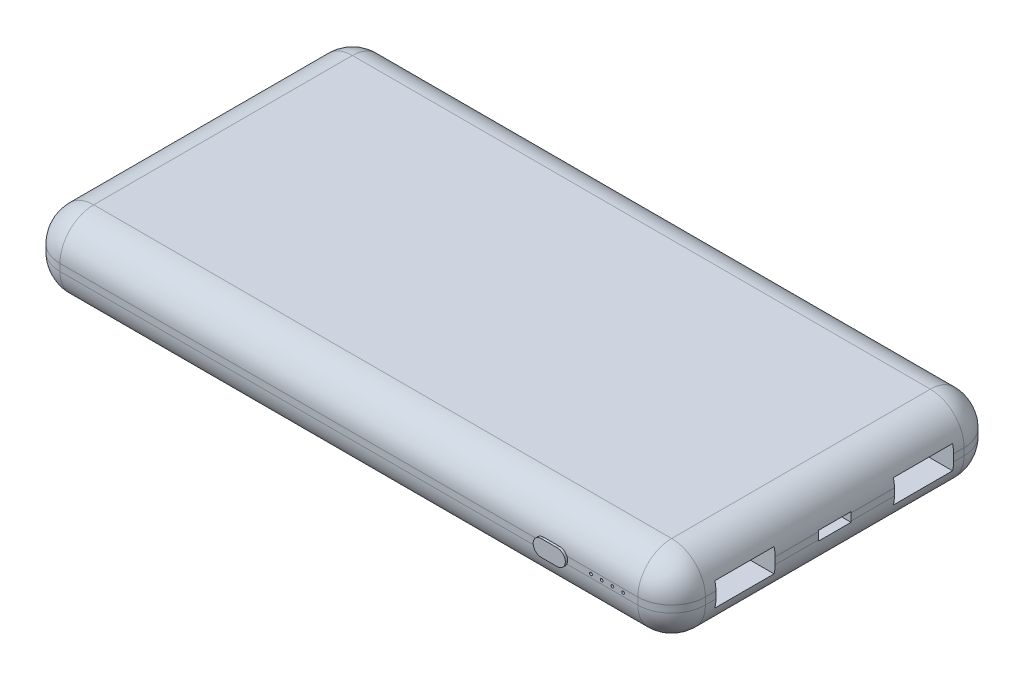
ISO-10303-21;
HEADER;
FILE_DESCRIPTION(('STEP AP214'),'2;1');
FILE_NAME('part.step','',(''),(''),'','','');
FILE_SCHEMA(('AUTOMOTIVE_DESIGN { 1 0 10303 214 1 1 1 1 }'));
ENDSEC;
DATA;
#1=APPLICATION_CONTEXT('core data for automotive mechanical design processes');
#2=APPLICATION_PROTOCOL_DEFINITION('international standard','automotive_design',2000,#1);
#3=PRODUCT_CONTEXT('',#1,'mechanical');
#4=PRODUCT('Part','Part','',(#3));
#5=PRODUCT_RELATED_PRODUCT_CATEGORY('part','',(#4));
#6=PRODUCT_DEFINITION_FORMATION('','',#4);
#7=PRODUCT_DEFINITION_CONTEXT('part definition',#1,'design');
#8=PRODUCT_DEFINITION('design','',#6,#7);
#9=PRODUCT_DEFINITION_SHAPE('','',#8);
#10=(LENGTH_UNIT() NAMED_UNIT(*) SI_UNIT(.MILLI.,.METRE.));
#11=(NAMED_UNIT(*) PLANE_ANGLE_UNIT() SI_UNIT($,.RADIAN.));
#12=(NAMED_UNIT(*) SI_UNIT($,.STERADIAN.) SOLID_ANGLE_UNIT());
#13=UNCERTAINTY_MEASURE_WITH_UNIT(LENGTH_MEASURE(1.E-05),#10,'distance_accuracy_value','');
#14=(GEOMETRIC_REPRESENTATION_CONTEXT(3) GLOBAL_UNCERTAINTY_ASSIGNED_CONTEXT((#13)) GLOBAL_UNIT_ASSIGNED_CONTEXT((#10,
#11,#12)) REPRESENTATION_CONTEXT('',''));
#15=CARTESIAN_POINT('',(0.,0.,0.));
#16=DIRECTION('',(0.,0.,1.));
#17=DIRECTION('',(1.,0.,0.));
#18=AXIS2_PLACEMENT_3D('',#15,#16,#17);
#19=CARTESIAN_POINT('',(-69.25,8.,35.));
#20=DIRECTION('',(0.,0.,-1.));
#21=DIRECTION('',(-1.,0.,0.));
#22=AXIS2_PLACEMENT_3D('',#19,#20,#21);
#23=PLANE('',#22);
#24=CARTESIAN_POINT('',(51.94,0.,35.));
#25=DIRECTION('',(0.,0.,1.));
#26=DIRECTION('',(1.,0.,0.));
#27=AXIS2_PLACEMENT_3D('',#24,#25,#26);
#28=CIRCLE('',#27,0.300000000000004);
#29=CARTESIAN_POINT('',(52.24,0.,35.));
#30=VERTEX_POINT('',#29);
#31=EDGE_CURVE('E943',#30,#30,#28,.T.);
#32=ORIENTED_EDGE('',*,*,#31,.F.);
#33=EDGE_LOOP('',(#32));
#34=FACE_BOUND('',#33,.T.);
#35=CARTESIAN_POINT('',(54.24,0.,35.));
#36=DIRECTION('',(0.,0.,1.));
#37=DIRECTION('',(1.,0.,0.));
#38=AXIS2_PLACEMENT_3D('',#35,#36,#37);
#39=CIRCLE('',#38,0.299999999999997);
#40=CARTESIAN_POINT('',(54.54,0.,35.));
#41=VERTEX_POINT('',#40);
#42=EDGE_CURVE('E953',#41,#41,#39,.T.);
#43=ORIENTED_EDGE('',*,*,#42,.F.);
#44=EDGE_LOOP('',(#43));
#45=FACE_BOUND('',#44,.T.);
#46=CARTESIAN_POINT('',(56.54,0.,35.));
#47=DIRECTION('',(0.,0.,1.));
#48=DIRECTION('',(1.,0.,0.));
#49=AXIS2_PLACEMENT_3D('',#46,#47,#48);
#50=CIRCLE('',#49,0.300000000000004);
#51=CARTESIAN_POINT('',(56.84,0.,35.));
#52=VERTEX_POINT('',#51);
#53=EDGE_CURVE('E959',#52,#52,#50,.T.);
#54=ORIENTED_EDGE('',*,*,#53,.F.);
#55=EDGE_LOOP('',(#54));
#56=FACE_BOUND('',#55,.T.);
#57=CARTESIAN_POINT('',(58.84,0.,35.));
#58=DIRECTION('',(0.,0.,1.));
#59=DIRECTION('',(1.,0.,0.));
#60=AXIS2_PLACEMENT_3D('',#57,#58,#59);
#61=CIRCLE('',#60,0.30000000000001);
#62=CARTESIAN_POINT('',(59.14,0.,35.));
#63=VERTEX_POINT('',#62);
#64=EDGE_CURVE('E965',#63,#63,#61,.T.);
#65=ORIENTED_EDGE('',*,*,#64,.F.);
#66=EDGE_LOOP('',(#65));
#67=FACE_BOUND('',#66,.T.);
#68=DIRECTION('',(1.,0.,0.));
#69=VECTOR('',#68,1.);
#70=CARTESIAN_POINT('',(-69.25,0.75,35.));
#71=LINE('',#70,#69);
#72=CARTESIAN_POINT('',(62.,0.75,35.));
#73=VERTEX_POINT('',#72);
#74=CARTESIAN_POINT('',(46.7711388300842,0.75,35.));
#75=VERTEX_POINT('',#74);
#76=EDGE_CURVE('E476',#73,#75,#71,.F.);
#77=ORIENTED_EDGE('',*,*,#76,.T.);
#78=CARTESIAN_POINT('',(45.19,0.,35.));
#79=DIRECTION('',(0.,0.,-1.));
#80=DIRECTION('',(-1.,0.,0.));
#81=AXIS2_PLACEMENT_3D('',#78,#79,#80);
#82=CIRCLE('',#81,1.75);
#83=CARTESIAN_POINT('',(46.94,0.,35.));
#84=VERTEX_POINT('',#83);
#85=EDGE_CURVE('E11',#75,#84,#82,.T.);
#86=ORIENTED_EDGE('',*,*,#85,.T.);
#87=CARTESIAN_POINT('',(45.19,0.,35.));
#88=DIRECTION('',(0.,0.,-1.));
#89=DIRECTION('',(-1.,0.,0.));
#90=AXIS2_PLACEMENT_3D('',#87,#88,#89);
#91=CIRCLE('',#90,1.75);
#92=CARTESIAN_POINT('',(46.7711388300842,-0.750000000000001,35.));
#93=VERTEX_POINT('',#92);
#94=EDGE_CURVE('E45',#84,#93,#91,.T.);
#95=ORIENTED_EDGE('',*,*,#94,.T.);
#96=DIRECTION('',(1.,0.,0.));
#97=VECTOR('',#96,1.);
#98=CARTESIAN_POINT('',(69.25,-0.750000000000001,35.));
#99=LINE('',#98,#97);
#100=CARTESIAN_POINT('',(62.,-0.750000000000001,35.));
#101=VERTEX_POINT('',#100);
#102=EDGE_CURVE('E53',#93,#101,#99,.T.);
#103=ORIENTED_EDGE('',*,*,#102,.T.);
#104=DIRECTION('',(0.,-1.,0.));
#105=VECTOR('',#104,1.);
#106=CARTESIAN_POINT('',(62.,8.,35.));
#107=LINE('',#106,#105);
#108=EDGE_CURVE('E479',#101,#73,#107,.F.);
#109=ORIENTED_EDGE('',*,*,#108,.T.);
#110=EDGE_LOOP('',(#77,#86,#95,#103,#109));
#111=FACE_BOUND('',#110,.T.);
#112=ADVANCED_FACE('F35',(#34,#45,#56,#67,#111),#23,.F.);
#113=CARTESIAN_POINT('',(41.79,0.,35.));
#114=DIRECTION('',(0.,0.,-1.));
#115=DIRECTION('',(-1.,0.,0.));
#116=AXIS2_PLACEMENT_3D('',#113,#114,#115);
#117=CIRCLE('',#116,1.75);
#118=CARTESIAN_POINT('',(40.2088611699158,-0.750000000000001,35.));
#119=VERTEX_POINT('',#118);
#120=CARTESIAN_POINT('',(40.04,0.,35.));
#121=VERTEX_POINT('',#120);
#122=EDGE_CURVE('E926',#119,#121,#117,.T.);
#123=ORIENTED_EDGE('',*,*,#122,.T.);
#124=CARTESIAN_POINT('',(41.79,0.,35.));
#125=DIRECTION('',(0.,0.,-1.));
#126=DIRECTION('',(-1.,0.,0.));
#127=AXIS2_PLACEMENT_3D('',#124,#125,#126);
#128=CIRCLE('',#127,1.75);
#129=CARTESIAN_POINT('',(40.2088611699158,0.75,35.));
#130=VERTEX_POINT('',#129);
#131=EDGE_CURVE('E807',#121,#130,#128,.T.);
#132=ORIENTED_EDGE('',*,*,#131,.T.);
#133=CARTESIAN_POINT('',(-62.,0.75,35.));
#134=VERTEX_POINT('',#133);
#135=EDGE_CURVE('E473',#130,#134,#71,.F.);
#136=ORIENTED_EDGE('',*,*,#135,.T.);
#137=DIRECTION('',(0.,-1.,0.));
#138=VECTOR('',#137,1.);
#139=CARTESIAN_POINT('',(-62.,8.,35.));
#140=LINE('',#139,#138);
#141=CARTESIAN_POINT('',(-62.,-0.750000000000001,35.));
#142=VERTEX_POINT('',#141);
#143=EDGE_CURVE('E481',#134,#142,#140,.T.);
#144=ORIENTED_EDGE('',*,*,#143,.T.);
#145=EDGE_CURVE('E484',#142,#119,#99,.T.);
#146=ORIENTED_EDGE('',*,*,#145,.T.);
#147=EDGE_LOOP('',(#123,#132,#136,#144,#146));
#148=FACE_BOUND('',#147,.T.);
#149=ADVANCED_FACE('F686',(#148),#23,.F.);
#150=CARTESIAN_POINT('',(-69.25,8.,-35.));
#151=DIRECTION('',(0.,0.,1.));
#152=DIRECTION('',(1.,0.,0.));
#153=AXIS2_PLACEMENT_3D('',#150,#151,#152);
#154=PLANE('',#153);
#155=DIRECTION('',(-1.,0.,0.));
#156=VECTOR('',#155,1.);
#157=CARTESIAN_POINT('',(-69.25,0.75,-35.));
#158=LINE('',#157,#156);
#159=CARTESIAN_POINT('',(-62.,0.75,-35.));
#160=VERTEX_POINT('',#159);
#161=CARTESIAN_POINT('',(42.0631097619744,0.75,-35.));
#162=VERTEX_POINT('',#161);
#163=EDGE_CURVE('E448',#160,#162,#158,.F.);
#164=ORIENTED_EDGE('',*,*,#163,.T.);
#165=CARTESIAN_POINT('',(43.088,0.,-35.));
#166=DIRECTION('',(0.,0.,1.));
#167=DIRECTION('',(1.,0.,0.));
#168=AXIS2_PLACEMENT_3D('',#165,#166,#167);
#169=CIRCLE('',#168,1.27);
#170=CARTESIAN_POINT('',(41.818,0.,-35.));
#171=VERTEX_POINT('',#170);
#172=EDGE_CURVE('E626',#162,#171,#169,.T.);
#173=ORIENTED_EDGE('',*,*,#172,.T.);
#174=CARTESIAN_POINT('',(43.088,0.,-35.));
#175=DIRECTION('',(0.,0.,1.));
#176=DIRECTION('',(1.,0.,0.));
#177=AXIS2_PLACEMENT_3D('',#174,#175,#176);
#178=CIRCLE('',#177,1.27);
#179=CARTESIAN_POINT('',(42.0631097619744,-0.750000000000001,-35.));
#180=VERTEX_POINT('',#179);
#181=EDGE_CURVE('E839',#171,#180,#178,.T.);
#182=ORIENTED_EDGE('',*,*,#181,.T.);
#183=DIRECTION('',(-1.,0.,0.));
#184=VECTOR('',#183,1.);
#185=CARTESIAN_POINT('',(-69.25,-0.750000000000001,-35.));
#186=LINE('',#185,#184);
#187=CARTESIAN_POINT('',(-62.,-0.750000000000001,-35.));
#188=VERTEX_POINT('',#187);
#189=EDGE_CURVE('E455',#180,#188,#186,.T.);
#190=ORIENTED_EDGE('',*,*,#189,.T.);
#191=DIRECTION('',(0.,-1.,0.));
#192=VECTOR('',#191,1.);
#193=CARTESIAN_POINT('',(-62.,8.,-35.));
#194=LINE('',#193,#192);
#195=EDGE_CURVE('E452',#188,#160,#194,.F.);
#196=ORIENTED_EDGE('',*,*,#195,.T.);
#197=EDGE_LOOP('',(#164,#173,#182,#190,#196));
#198=FACE_BOUND('',#197,.T.);
#199=ADVANCED_FACE('F692',(#198),#154,.F.);
#200=CARTESIAN_POINT('',(69.25,8.,35.));
#201=DIRECTION('',(-1.,0.,0.));
#202=DIRECTION('',(0.,0.,1.));
#203=AXIS2_PLACEMENT_3D('',#200,#201,#202);
#204=PLANE('',#203);
#205=DIRECTION('',(0.,0.,-1.));
#206=VECTOR('',#205,1.);
#207=CARTESIAN_POINT('',(69.25,0.75,35.));
#208=LINE('',#207,#206);
#209=CARTESIAN_POINT('',(69.25,0.75,-12.8));
#210=VERTEX_POINT('',#209);
#211=CARTESIAN_POINT('',(69.25,0.75,-3.5));
#212=VERTEX_POINT('',#211);
#213=EDGE_CURVE('E463',#210,#212,#208,.F.);
#214=ORIENTED_EDGE('',*,*,#213,.T.);
#215=DIRECTION('',(0.,1.,0.));
#216=VECTOR('',#215,1.);
#217=CARTESIAN_POINT('',(69.25,-1.,-3.5));
#218=LINE('',#217,#216);
#219=CARTESIAN_POINT('',(69.25,-0.750000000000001,-3.5));
#220=VERTEX_POINT('',#219);
#221=EDGE_CURVE('E352',#220,#212,#218,.T.);
#222=ORIENTED_EDGE('',*,*,#221,.F.);
#223=DIRECTION('',(0.,0.,-1.));
#224=VECTOR('',#223,1.);
#225=CARTESIAN_POINT('',(69.25,-0.750000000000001,-35.));
#226=LINE('',#225,#224);
#227=CARTESIAN_POINT('',(69.25,-0.750000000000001,-12.8));
#228=VERTEX_POINT('',#227);
#229=EDGE_CURVE('E475',#220,#228,#226,.T.);
#230=ORIENTED_EDGE('',*,*,#229,.T.);
#231=DIRECTION('',(0.,-1.,0.));
#232=VECTOR('',#231,1.);
#233=CARTESIAN_POINT('',(69.25,-2.54,-12.8));
#234=LINE('',#233,#232);
#235=EDGE_CURVE('E406',#210,#228,#234,.T.);
#236=ORIENTED_EDGE('',*,*,#235,.F.);
#237=EDGE_LOOP('',(#214,#222,#230,#236));
#238=FACE_BOUND('',#237,.T.);
#239=ADVANCED_FACE('F714',(#238),#204,.F.);
#240=CARTESIAN_POINT('',(69.25,-0.750000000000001,12.8));
#241=VERTEX_POINT('',#240);
#242=CARTESIAN_POINT('',(69.25,-0.750000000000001,3.5));
#243=VERTEX_POINT('',#242);
#244=EDGE_CURVE('E474',#241,#243,#226,.T.);
#245=ORIENTED_EDGE('',*,*,#244,.T.);
#246=DIRECTION('',(0.,-1.,0.));
#247=VECTOR('',#246,1.);
#248=CARTESIAN_POINT('',(69.25,-1.,3.5));
#249=LINE('',#248,#247);
#250=CARTESIAN_POINT('',(69.25,0.75,3.5));
#251=VERTEX_POINT('',#250);
#252=EDGE_CURVE('E350',#251,#243,#249,.T.);
#253=ORIENTED_EDGE('',*,*,#252,.F.);
#254=CARTESIAN_POINT('',(69.25,0.75,12.8));
#255=VERTEX_POINT('',#254);
#256=EDGE_CURVE('E464',#251,#255,#208,.F.);
#257=ORIENTED_EDGE('',*,*,#256,.T.);
#258=DIRECTION('',(0.,1.,0.));
#259=VECTOR('',#258,1.);
#260=CARTESIAN_POINT('',(69.25,-2.54,12.8));
#261=LINE('',#260,#259);
#262=EDGE_CURVE('E385',#241,#255,#261,.T.);
#263=ORIENTED_EDGE('',*,*,#262,.F.);
#264=EDGE_LOOP('',(#245,#253,#257,#263));
#265=FACE_BOUND('',#264,.T.);
#266=ADVANCED_FACE('F1175',(#265),#204,.F.);
#267=CARTESIAN_POINT('',(69.25,0.75,-27.75));
#268=VERTEX_POINT('',#267);
#269=CARTESIAN_POINT('',(69.25,0.75,-25.5));
#270=VERTEX_POINT('',#269);
#271=EDGE_CURVE('E459',#268,#270,#208,.F.);
#272=ORIENTED_EDGE('',*,*,#271,.T.);
#273=DIRECTION('',(0.,1.,0.));
#274=VECTOR('',#273,1.);
#275=CARTESIAN_POINT('',(69.25,-2.54,-25.5));
#276=LINE('',#275,#274);
#277=CARTESIAN_POINT('',(69.25,-0.750000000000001,-25.5));
#278=VERTEX_POINT('',#277);
#279=EDGE_CURVE('E370',#278,#270,#276,.T.);
#280=ORIENTED_EDGE('',*,*,#279,.F.);
#281=CARTESIAN_POINT('',(69.25,-0.750000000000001,-27.75));
#282=VERTEX_POINT('',#281);
#283=EDGE_CURVE('E469',#278,#282,#226,.T.);
#284=ORIENTED_EDGE('',*,*,#283,.T.);
#285=DIRECTION('',(0.,-1.,0.));
#286=VECTOR('',#285,1.);
#287=CARTESIAN_POINT('',(69.25,8.,-27.75));
#288=LINE('',#287,#286);
#289=EDGE_CURVE('E466',#282,#268,#288,.F.);
#290=ORIENTED_EDGE('',*,*,#289,.T.);
#291=EDGE_LOOP('',(#272,#280,#284,#290));
#292=FACE_BOUND('',#291,.T.);
#293=ADVANCED_FACE('F712',(#292),#204,.F.);
#294=CARTESIAN_POINT('',(69.25,-0.750000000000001,27.75));
#295=VERTEX_POINT('',#294);
#296=CARTESIAN_POINT('',(69.25,-0.750000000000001,25.5));
#297=VERTEX_POINT('',#296);
#298=EDGE_CURVE('E470',#295,#297,#226,.T.);
#299=ORIENTED_EDGE('',*,*,#298,.T.);
#300=DIRECTION('',(0.,-1.,0.));
#301=VECTOR('',#300,1.);
#302=CARTESIAN_POINT('',(69.25,-2.54,25.5));
#303=LINE('',#302,#301);
#304=CARTESIAN_POINT('',(69.25,0.75,25.5));
#305=VERTEX_POINT('',#304);
#306=EDGE_CURVE('E375',#305,#297,#303,.T.);
#307=ORIENTED_EDGE('',*,*,#306,.F.);
#308=CARTESIAN_POINT('',(69.25,0.75,27.75));
#309=VERTEX_POINT('',#308);
#310=EDGE_CURVE('E458',#305,#309,#208,.F.);
#311=ORIENTED_EDGE('',*,*,#310,.T.);
#312=DIRECTION('',(0.,-1.,0.));
#313=VECTOR('',#312,1.);
#314=CARTESIAN_POINT('',(69.25,8.,27.75));
#315=LINE('',#314,#313);
#316=EDGE_CURVE('E462',#309,#295,#315,.T.);
#317=ORIENTED_EDGE('',*,*,#316,.T.);
#318=EDGE_LOOP('',(#299,#307,#311,#317));
#319=FACE_BOUND('',#318,.T.);
#320=ADVANCED_FACE('F708',(#319),#204,.F.);
#321=CARTESIAN_POINT('',(62.,-0.750000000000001,-35.));
#322=VERTEX_POINT('',#321);
#323=CARTESIAN_POINT('',(49.9548902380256,-0.750000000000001,-35.));
#324=VERTEX_POINT('',#323);
#325=EDGE_CURVE('E456',#322,#324,#186,.T.);
#326=ORIENTED_EDGE('',*,*,#325,.T.);
#327=CARTESIAN_POINT('',(48.93,0.,-35.));
#328=DIRECTION('',(0.,0.,1.));
#329=DIRECTION('',(1.,0.,0.));
#330=AXIS2_PLACEMENT_3D('',#327,#328,#329);
#331=CIRCLE('',#330,1.27);
#332=CARTESIAN_POINT('',(50.2,0.,-35.));
#333=VERTEX_POINT('',#332);
#334=EDGE_CURVE('E747',#324,#333,#331,.T.);
#335=ORIENTED_EDGE('',*,*,#334,.T.);
#336=CARTESIAN_POINT('',(48.93,0.,-35.));
#337=DIRECTION('',(0.,0.,1.));
#338=DIRECTION('',(1.,0.,0.));
#339=AXIS2_PLACEMENT_3D('',#336,#337,#338);
#340=CIRCLE('',#339,1.27);
#341=CARTESIAN_POINT('',(49.9548902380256,0.75,-35.));
#342=VERTEX_POINT('',#341);
#343=EDGE_CURVE('E653',#333,#342,#340,.T.);
#344=ORIENTED_EDGE('',*,*,#343,.T.);
#345=CARTESIAN_POINT('',(62.,0.75,-35.));
#346=VERTEX_POINT('',#345);
#347=EDGE_CURVE('E447',#342,#346,#158,.F.);
#348=ORIENTED_EDGE('',*,*,#347,.T.);
#349=DIRECTION('',(0.,-1.,0.));
#350=VECTOR('',#349,1.);
#351=CARTESIAN_POINT('',(62.,8.,-35.));
#352=LINE('',#351,#350);
#353=EDGE_CURVE('E450',#346,#322,#352,.T.);
#354=ORIENTED_EDGE('',*,*,#353,.T.);
#355=EDGE_LOOP('',(#326,#335,#344,#348,#354));
#356=FACE_BOUND('',#355,.T.);
#357=ADVANCED_FACE('F704',(#356),#154,.F.);
#358=CARTESIAN_POINT('',(-69.25,8.,35.));
#359=DIRECTION('',(1.,0.,0.));
#360=DIRECTION('',(0.,0.,-1.));
#361=AXIS2_PLACEMENT_3D('',#358,#359,#360);
#362=PLANE('',#361);
#363=DIRECTION('',(0.,-1.,0.));
#364=VECTOR('',#363,1.);
#365=CARTESIAN_POINT('',(-69.25,8.,-27.75));
#366=LINE('',#365,#364);
#367=CARTESIAN_POINT('',(-69.25,0.75,-27.75));
#368=VERTEX_POINT('',#367);
#369=CARTESIAN_POINT('',(-69.25,-0.750000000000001,-27.75));
#370=VERTEX_POINT('',#369);
#371=EDGE_CURVE('E442',#368,#370,#366,.T.);
#372=ORIENTED_EDGE('',*,*,#371,.T.);
#373=DIRECTION('',(0.,0.,1.));
#374=VECTOR('',#373,1.);
#375=CARTESIAN_POINT('',(-69.25,-0.750000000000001,35.));
#376=LINE('',#375,#374);
#377=CARTESIAN_POINT('',(-69.25,-0.750000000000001,27.75));
#378=VERTEX_POINT('',#377);
#379=EDGE_CURVE('E445',#370,#378,#376,.T.);
#380=ORIENTED_EDGE('',*,*,#379,.T.);
#381=DIRECTION('',(0.,-1.,0.));
#382=VECTOR('',#381,1.);
#383=CARTESIAN_POINT('',(-69.25,8.,27.75));
#384=LINE('',#383,#382);
#385=CARTESIAN_POINT('',(-69.25,0.75,27.75));
#386=VERTEX_POINT('',#385);
#387=EDGE_CURVE('E439',#378,#386,#384,.F.);
#388=ORIENTED_EDGE('',*,*,#387,.T.);
#389=DIRECTION('',(0.,0.,1.));
#390=VECTOR('',#389,1.);
#391=CARTESIAN_POINT('',(-69.25,0.75,35.));
#392=LINE('',#391,#390);
#393=EDGE_CURVE('E437',#386,#368,#392,.F.);
#394=ORIENTED_EDGE('',*,*,#393,.T.);
#395=EDGE_LOOP('',(#372,#380,#388,#394));
#396=FACE_BOUND('',#395,.T.);
#397=ADVANCED_FACE('F700',(#396),#362,.F.);
#398=CARTESIAN_POINT('',(0.,8.,0.));
#399=DIRECTION('',(0.,-1.,0.));
#400=DIRECTION('',(0.,0.,-1.));
#401=AXIS2_PLACEMENT_3D('',#398,#399,#400);
#402=PLANE('',#401);
#403=DIRECTION('',(0.,0.,1.));
#404=VECTOR('',#403,1.);
#405=CARTESIAN_POINT('',(-62.,8.,0.));
#406=LINE('',#405,#404);
#407=CARTESIAN_POINT('',(-62.,8.,-27.75));
#408=VERTEX_POINT('',#407);
#409=CARTESIAN_POINT('',(-62.,8.,27.75));
#410=VERTEX_POINT('',#409);
#411=EDGE_CURVE('E500',#408,#410,#406,.T.);
#412=ORIENTED_EDGE('',*,*,#411,.T.);
#413=DIRECTION('',(1.,0.,0.));
#414=VECTOR('',#413,1.);
#415=CARTESIAN_POINT('',(0.,8.,27.75));
#416=LINE('',#415,#414);
#417=CARTESIAN_POINT('',(62.,8.,27.75));
#418=VERTEX_POINT('',#417);
#419=EDGE_CURVE('E502',#410,#418,#416,.T.);
#420=ORIENTED_EDGE('',*,*,#419,.T.);
#421=DIRECTION('',(0.,0.,-1.));
#422=VECTOR('',#421,1.);
#423=CARTESIAN_POINT('',(62.,8.,0.));
#424=LINE('',#423,#422);
#425=CARTESIAN_POINT('',(62.,8.,-27.75));
#426=VERTEX_POINT('',#425);
#427=EDGE_CURVE('E496',#418,#426,#424,.T.);
#428=ORIENTED_EDGE('',*,*,#427,.T.);
#429=DIRECTION('',(-1.,0.,0.));
#430=VECTOR('',#429,1.);
#431=CARTESIAN_POINT('',(0.,8.,-27.75));
#432=LINE('',#431,#430);
#433=EDGE_CURVE('E498',#426,#408,#432,.T.);
#434=ORIENTED_EDGE('',*,*,#433,.T.);
#435=EDGE_LOOP('',(#412,#420,#428,#434));
#436=FACE_BOUND('',#435,.T.);
#437=ADVANCED_FACE('F703',(#436),#402,.F.);
#438=CARTESIAN_POINT('',(0.,-8.,0.));
#439=DIRECTION('',(0.,-1.,0.));
#440=DIRECTION('',(0.,0.,-1.));
#441=AXIS2_PLACEMENT_3D('',#438,#439,#440);
#442=PLANE('',#441);
#443=DIRECTION('',(0.,0.,1.));
#444=VECTOR('',#443,1.);
#445=CARTESIAN_POINT('',(-62.,-8.,-35.));
#446=LINE('',#445,#444);
#447=CARTESIAN_POINT('',(-62.,-8.,27.75));
#448=VERTEX_POINT('',#447);
#449=CARTESIAN_POINT('',(-62.,-8.,-27.75));
#450=VERTEX_POINT('',#449);
#451=EDGE_CURVE('E491',#448,#450,#446,.F.);
#452=ORIENTED_EDGE('',*,*,#451,.T.);
#453=DIRECTION('',(-1.,0.,0.));
#454=VECTOR('',#453,1.);
#455=CARTESIAN_POINT('',(69.25,-8.,-27.75));
#456=LINE('',#455,#454);
#457=CARTESIAN_POINT('',(62.,-8.,-27.75));
#458=VERTEX_POINT('',#457);
#459=EDGE_CURVE('E493',#450,#458,#456,.F.);
#460=ORIENTED_EDGE('',*,*,#459,.T.);
#461=DIRECTION('',(0.,0.,-1.));
#462=VECTOR('',#461,1.);
#463=CARTESIAN_POINT('',(62.,-8.,35.));
#464=LINE('',#463,#462);
#465=CARTESIAN_POINT('',(62.,-8.,27.75));
#466=VERTEX_POINT('',#465);
#467=EDGE_CURVE('E486',#458,#466,#464,.F.);
#468=ORIENTED_EDGE('',*,*,#467,.T.);
#469=DIRECTION('',(1.,0.,0.));
#470=VECTOR('',#469,1.);
#471=CARTESIAN_POINT('',(-69.25,-8.,27.75));
#472=LINE('',#471,#470);
#473=EDGE_CURVE('E489',#466,#448,#472,.F.);
#474=ORIENTED_EDGE('',*,*,#473,.T.);
#475=EDGE_LOOP('',(#452,#460,#468,#474));
#476=FACE_BOUND('',#475,.T.);
#477=ADVANCED_FACE('F698',(#476),#442,.T.);
#478=CARTESIAN_POINT('',(62.,8.,27.75));
#479=DIRECTION('',(0.,-1.,0.));
#480=DIRECTION('',(0.,0.,-1.));
#481=AXIS2_PLACEMENT_3D('',#478,#479,#480);
#482=CYLINDRICAL_SURFACE('',#481,7.25);
#483=CARTESIAN_POINT('',(62.,0.75,27.75));
#484=DIRECTION('',(0.,1.,0.));
#485=DIRECTION('',(0.,0.,1.));
#486=AXIS2_PLACEMENT_3D('',#483,#484,#485);
#487=CIRCLE('',#486,7.25);
#488=EDGE_CURVE('E440',#73,#309,#487,.T.);
#489=ORIENTED_EDGE('',*,*,#488,.F.);
#490=ORIENTED_EDGE('',*,*,#108,.F.);
#491=CARTESIAN_POINT('',(62.,-0.750000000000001,27.75));
#492=DIRECTION('',(0.,-1.,0.));
#493=DIRECTION('',(0.,0.,-1.));
#494=AXIS2_PLACEMENT_3D('',#491,#492,#493);
#495=CIRCLE('',#494,7.25);
#496=EDGE_CURVE('E565',#295,#101,#495,.T.);
#497=ORIENTED_EDGE('',*,*,#496,.F.);
#498=ORIENTED_EDGE('',*,*,#316,.F.);
#499=EDGE_LOOP('',(#489,#490,#497,#498));
#500=FACE_BOUND('',#499,.T.);
#501=ADVANCED_FACE('F902',(#500),#482,.T.);
#502=CARTESIAN_POINT('',(62.,0.75,27.75));
#503=DIRECTION('',(0.,0.,1.));
#504=DIRECTION('',(1.,0.,0.));
#505=AXIS2_PLACEMENT_3D('',#502,#503,#504);
#506=SPHERICAL_SURFACE('',#505,7.25);
#507=CARTESIAN_POINT('',(62.,0.75,27.75));
#508=DIRECTION('',(1.,0.,0.));
#509=DIRECTION('',(0.,0.,-1.));
#510=AXIS2_PLACEMENT_3D('',#507,#508,#509);
#511=CIRCLE('',#510,7.25);
#512=EDGE_CURVE('E559',#73,#418,#511,.F.);
#513=ORIENTED_EDGE('',*,*,#512,.F.);
#514=ORIENTED_EDGE('',*,*,#488,.T.);
#515=CARTESIAN_POINT('',(62.,0.75,27.75));
#516=DIRECTION('',(0.,0.,1.));
#517=DIRECTION('',(1.,0.,0.));
#518=AXIS2_PLACEMENT_3D('',#515,#516,#517);
#519=CIRCLE('',#518,7.25);
#520=EDGE_CURVE('E562',#418,#309,#519,.F.);
#521=ORIENTED_EDGE('',*,*,#520,.F.);
#522=EDGE_LOOP('',(#513,#514,#521));
#523=FACE_BOUND('',#522,.T.);
#524=ADVANCED_FACE('F899',(#523),#506,.T.);
#525=CARTESIAN_POINT('',(62.,-0.75,27.75));
#526=DIRECTION('',(0.,0.,1.));
#527=DIRECTION('',(1.,0.,0.));
#528=AXIS2_PLACEMENT_3D('',#525,#526,#527);
#529=SPHERICAL_SURFACE('',#528,7.25);
#530=CARTESIAN_POINT('',(62.,-0.75,27.75));
#531=DIRECTION('',(0.,0.,1.));
#532=DIRECTION('',(1.,0.,0.));
#533=AXIS2_PLACEMENT_3D('',#530,#531,#532);
#534=CIRCLE('',#533,7.25);
#535=EDGE_CURVE('E554',#295,#466,#534,.F.);
#536=ORIENTED_EDGE('',*,*,#535,.F.);
#537=ORIENTED_EDGE('',*,*,#496,.T.);
#538=CARTESIAN_POINT('',(62.,-0.750000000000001,27.75));
#539=DIRECTION('',(1.,0.,0.));
#540=DIRECTION('',(0.,0.,-1.));
#541=AXIS2_PLACEMENT_3D('',#538,#539,#540);
#542=CIRCLE('',#541,7.25);
#543=EDGE_CURVE('E557',#466,#101,#542,.F.);
#544=ORIENTED_EDGE('',*,*,#543,.F.);
#545=EDGE_LOOP('',(#536,#537,#544));
#546=FACE_BOUND('',#545,.T.);
#547=ADVANCED_FACE('F895',(#546),#529,.T.);
#548=CARTESIAN_POINT('',(62.,0.75,0.));
#549=DIRECTION('',(0.,0.,-1.));
#550=DIRECTION('',(-1.,0.,0.));
#551=AXIS2_PLACEMENT_3D('',#548,#549,#550);
#552=CYLINDRICAL_SURFACE('',#551,7.25);
#553=CARTESIAN_POINT('',(62.,0.75,-3.5));
#554=DIRECTION('',(0.,0.,-1.));
#555=DIRECTION('',(-1.,0.,0.));
#556=AXIS2_PLACEMENT_3D('',#553,#554,#555);
#557=CIRCLE('',#556,7.25);
#558=CARTESIAN_POINT('',(69.2456883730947,1.,-3.5));
#559=VERTEX_POINT('',#558);
#560=EDGE_CURVE('E333',#212,#559,#557,.F.);
#561=ORIENTED_EDGE('',*,*,#560,.F.);
#562=ORIENTED_EDGE('',*,*,#213,.F.);
#563=CARTESIAN_POINT('',(62.,0.75,-12.8));
#564=DIRECTION('',(0.,0.,1.));
#565=DIRECTION('',(1.,0.,0.));
#566=AXIS2_PLACEMENT_3D('',#563,#564,#565);
#567=CIRCLE('',#566,7.25);
#568=CARTESIAN_POINT('',(69.0255533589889,2.54,-12.8));
#569=VERTEX_POINT('',#568);
#570=EDGE_CURVE('E393',#569,#210,#567,.F.);
#571=ORIENTED_EDGE('',*,*,#570,.F.);
#572=DIRECTION('',(0.,0.,-1.));
#573=VECTOR('',#572,1.);
#574=CARTESIAN_POINT('',(69.0255533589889,2.54,0.));
#575=LINE('',#574,#573);
#576=CARTESIAN_POINT('',(69.0255533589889,2.54,-25.5));
#577=VERTEX_POINT('',#576);
#578=EDGE_CURVE('E581',#577,#569,#575,.F.);
#579=ORIENTED_EDGE('',*,*,#578,.F.);
#580=CARTESIAN_POINT('',(62.,0.75,-25.5));
#581=DIRECTION('',(0.,0.,-1.));
#582=DIRECTION('',(-1.,0.,0.));
#583=AXIS2_PLACEMENT_3D('',#580,#581,#582);
#584=CIRCLE('',#583,7.25);
#585=EDGE_CURVE('E430',#270,#577,#584,.F.);
#586=ORIENTED_EDGE('',*,*,#585,.F.);
#587=ORIENTED_EDGE('',*,*,#271,.F.);
#588=CARTESIAN_POINT('',(62.,0.75,-27.75));
#589=DIRECTION('',(0.,0.,-1.));
#590=DIRECTION('',(-1.,0.,0.));
#591=AXIS2_PLACEMENT_3D('',#588,#589,#590);
#592=CIRCLE('',#591,7.25);
#593=EDGE_CURVE('E549',#426,#268,#592,.T.);
#594=ORIENTED_EDGE('',*,*,#593,.F.);
#595=ORIENTED_EDGE('',*,*,#427,.F.);
#596=ORIENTED_EDGE('',*,*,#520,.T.);
#597=ORIENTED_EDGE('',*,*,#310,.F.);
#598=CARTESIAN_POINT('',(62.,0.75,25.5));
#599=DIRECTION('',(0.,0.,1.));
#600=DIRECTION('',(1.,0.,0.));
#601=AXIS2_PLACEMENT_3D('',#598,#599,#600);
#602=CIRCLE('',#601,7.25);
#603=CARTESIAN_POINT('',(69.0255533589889,2.54,25.5));
#604=VERTEX_POINT('',#603);
#605=EDGE_CURVE('E432',#604,#305,#602,.F.);
#606=ORIENTED_EDGE('',*,*,#605,.F.);
#607=DIRECTION('',(0.,0.,-1.));
#608=VECTOR('',#607,1.);
#609=CARTESIAN_POINT('',(69.0255533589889,2.54,0.));
#610=LINE('',#609,#608);
#611=CARTESIAN_POINT('',(69.0255533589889,2.54,12.8));
#612=VERTEX_POINT('',#611);
#613=EDGE_CURVE('E583',#612,#604,#610,.F.);
#614=ORIENTED_EDGE('',*,*,#613,.F.);
#615=CARTESIAN_POINT('',(62.,0.75,12.8));
#616=DIRECTION('',(0.,0.,-1.));
#617=DIRECTION('',(-1.,0.,0.));
#618=AXIS2_PLACEMENT_3D('',#615,#616,#617);
#619=CIRCLE('',#618,7.25);
#620=EDGE_CURVE('E434',#255,#612,#619,.F.);
#621=ORIENTED_EDGE('',*,*,#620,.F.);
#622=ORIENTED_EDGE('',*,*,#256,.F.);
#623=CARTESIAN_POINT('',(62.,0.75,3.5));
#624=DIRECTION('',(0.,0.,1.));
#625=DIRECTION('',(1.,0.,0.));
#626=AXIS2_PLACEMENT_3D('',#623,#624,#625);
#627=CIRCLE('',#626,7.25);
#628=CARTESIAN_POINT('',(69.2456883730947,1.,3.5));
#629=VERTEX_POINT('',#628);
#630=EDGE_CURVE('E363',#629,#251,#627,.F.);
#631=ORIENTED_EDGE('',*,*,#630,.F.);
#632=DIRECTION('',(0.,0.,-1.));
#633=VECTOR('',#632,1.);
#634=CARTESIAN_POINT('',(69.2456883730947,1.,0.));
#635=LINE('',#634,#633);
#636=EDGE_CURVE('E591',#559,#629,#635,.F.);
#637=ORIENTED_EDGE('',*,*,#636,.F.);
#638=EDGE_LOOP('',(#561,#562,#571,#579,#586,#587,#594,#595,#596,#597,#606,#614,#621,#622,#631,#637));
#639=FACE_BOUND('',#638,.T.);
#640=ADVANCED_FACE('F892',(#639),#552,.T.);
#641=CARTESIAN_POINT('',(0.,0.75,27.75));
#642=DIRECTION('',(1.,0.,0.));
#643=DIRECTION('',(0.,0.,-1.));
#644=AXIS2_PLACEMENT_3D('',#641,#642,#643);
#645=CYLINDRICAL_SURFACE('',#644,7.25);
#646=ORIENTED_EDGE('',*,*,#512,.T.);
#647=ORIENTED_EDGE('',*,*,#419,.F.);
#648=CARTESIAN_POINT('',(-62.,0.75,27.75));
#649=DIRECTION('',(-1.,0.,0.));
#650=DIRECTION('',(0.,0.,1.));
#651=AXIS2_PLACEMENT_3D('',#648,#649,#650);
#652=CIRCLE('',#651,7.25);
#653=EDGE_CURVE('E546',#134,#410,#652,.T.);
#654=ORIENTED_EDGE('',*,*,#653,.F.);
#655=ORIENTED_EDGE('',*,*,#135,.F.);
#656=DIRECTION('',(1.,0.,0.));
#657=VECTOR('',#656,1.);
#658=CARTESIAN_POINT('',(0.,0.75,35.));
#659=LINE('',#658,#657);
#660=EDGE_CURVE('E811',#75,#130,#659,.F.);
#661=ORIENTED_EDGE('',*,*,#660,.F.);
#662=ORIENTED_EDGE('',*,*,#76,.F.);
#663=EDGE_LOOP('',(#646,#647,#654,#655,#661,#662));
#664=FACE_BOUND('',#663,.T.);
#665=ADVANCED_FACE('F794',(#664),#645,.T.);
#666=CARTESIAN_POINT('',(-62.,8.,27.75));
#667=DIRECTION('',(0.,-1.,0.));
#668=DIRECTION('',(0.,0.,-1.));
#669=AXIS2_PLACEMENT_3D('',#666,#667,#668);
#670=CYLINDRICAL_SURFACE('',#669,7.25);
#671=CARTESIAN_POINT('',(-62.,-0.750000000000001,27.75));
#672=DIRECTION('',(0.,-1.,0.));
#673=DIRECTION('',(0.,0.,-1.));
#674=AXIS2_PLACEMENT_3D('',#671,#672,#673);
#675=CIRCLE('',#674,7.25);
#676=EDGE_CURVE('E540',#142,#378,#675,.T.);
#677=ORIENTED_EDGE('',*,*,#676,.F.);
#678=ORIENTED_EDGE('',*,*,#143,.F.);
#679=CARTESIAN_POINT('',(-62.,0.75,27.75));
#680=DIRECTION('',(0.,1.,0.));
#681=DIRECTION('',(0.,0.,1.));
#682=AXIS2_PLACEMENT_3D('',#679,#680,#681);
#683=CIRCLE('',#682,7.25);
#684=EDGE_CURVE('E543',#386,#134,#683,.T.);
#685=ORIENTED_EDGE('',*,*,#684,.F.);
#686=ORIENTED_EDGE('',*,*,#387,.F.);
#687=EDGE_LOOP('',(#677,#678,#685,#686));
#688=FACE_BOUND('',#687,.T.);
#689=ADVANCED_FACE('F802',(#688),#670,.T.);
#690=CARTESIAN_POINT('',(-69.25,-0.750000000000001,27.75));
#691=DIRECTION('',(-1.,0.,0.));
#692=DIRECTION('',(0.,0.,1.));
#693=AXIS2_PLACEMENT_3D('',#690,#691,#692);
#694=CYLINDRICAL_SURFACE('',#693,7.25);
#695=ORIENTED_EDGE('',*,*,#543,.T.);
#696=ORIENTED_EDGE('',*,*,#102,.F.);
#697=EDGE_CURVE('E487',#119,#93,#99,.T.);
#698=ORIENTED_EDGE('',*,*,#697,.F.);
#699=ORIENTED_EDGE('',*,*,#145,.F.);
#700=CARTESIAN_POINT('',(-62.,-0.75,27.75));
#701=DIRECTION('',(-1.,0.,0.));
#702=DIRECTION('',(0.,0.,1.));
#703=AXIS2_PLACEMENT_3D('',#700,#701,#702);
#704=CIRCLE('',#703,7.25);
#705=EDGE_CURVE('E538',#448,#142,#704,.T.);
#706=ORIENTED_EDGE('',*,*,#705,.F.);
#707=ORIENTED_EDGE('',*,*,#473,.F.);
#708=EDGE_LOOP('',(#695,#696,#698,#699,#706,#707));
#709=FACE_BOUND('',#708,.T.);
#710=ADVANCED_FACE('F868',(#709),#694,.T.);
#711=CARTESIAN_POINT('',(62.,-0.750000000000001,35.));
#712=DIRECTION('',(0.,0.,1.));
#713=DIRECTION('',(1.,0.,0.));
#714=AXIS2_PLACEMENT_3D('',#711,#712,#713);
#715=CYLINDRICAL_SURFACE('',#714,7.25);
#716=CARTESIAN_POINT('',(62.,-0.750000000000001,-3.5));
#717=DIRECTION('',(0.,0.,-1.));
#718=DIRECTION('',(-1.,0.,0.));
#719=AXIS2_PLACEMENT_3D('',#716,#717,#718);
#720=CIRCLE('',#719,7.25);
#721=CARTESIAN_POINT('',(69.2456883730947,-1.,-3.5));
#722=VERTEX_POINT('',#721);
#723=EDGE_CURVE('E589',#722,#220,#720,.F.);
#724=ORIENTED_EDGE('',*,*,#723,.F.);
#725=DIRECTION('',(0.,0.,1.));
#726=VECTOR('',#725,1.);
#727=CARTESIAN_POINT('',(69.2456883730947,-1.,35.));
#728=LINE('',#727,#726);
#729=CARTESIAN_POINT('',(69.2456883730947,-1.,3.5));
#730=VERTEX_POINT('',#729);
#731=EDGE_CURVE('E587',#730,#722,#728,.F.);
#732=ORIENTED_EDGE('',*,*,#731,.F.);
#733=CARTESIAN_POINT('',(62.,-0.750000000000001,3.5));
#734=DIRECTION('',(0.,0.,1.));
#735=DIRECTION('',(1.,0.,0.));
#736=AXIS2_PLACEMENT_3D('',#733,#734,#735);
#737=CIRCLE('',#736,7.25);
#738=EDGE_CURVE('E585',#243,#730,#737,.F.);
#739=ORIENTED_EDGE('',*,*,#738,.F.);
#740=ORIENTED_EDGE('',*,*,#244,.F.);
#741=CARTESIAN_POINT('',(62.,-0.750000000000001,12.8));
#742=DIRECTION('',(0.,0.,-1.));
#743=DIRECTION('',(-1.,0.,0.));
#744=AXIS2_PLACEMENT_3D('',#741,#742,#743);
#745=CIRCLE('',#744,7.25);
#746=CARTESIAN_POINT('',(69.0255533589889,-2.54,12.8));
#747=VERTEX_POINT('',#746);
#748=EDGE_CURVE('E579',#747,#241,#745,.F.);
#749=ORIENTED_EDGE('',*,*,#748,.F.);
#750=DIRECTION('',(0.,0.,1.));
#751=VECTOR('',#750,1.);
#752=CARTESIAN_POINT('',(69.0255533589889,-2.54,35.));
#753=LINE('',#752,#751);
#754=CARTESIAN_POINT('',(69.0255533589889,-2.54,25.5));
#755=VERTEX_POINT('',#754);
#756=EDGE_CURVE('E577',#755,#747,#753,.F.);
#757=ORIENTED_EDGE('',*,*,#756,.F.);
#758=CARTESIAN_POINT('',(62.,-0.750000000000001,25.5));
#759=DIRECTION('',(0.,0.,1.));
#760=DIRECTION('',(1.,0.,0.));
#761=AXIS2_PLACEMENT_3D('',#758,#759,#760);
#762=CIRCLE('',#761,7.25);
#763=EDGE_CURVE('E575',#297,#755,#762,.F.);
#764=ORIENTED_EDGE('',*,*,#763,.F.);
#765=ORIENTED_EDGE('',*,*,#298,.F.);
#766=ORIENTED_EDGE('',*,*,#535,.T.);
#767=ORIENTED_EDGE('',*,*,#467,.F.);
#768=CARTESIAN_POINT('',(62.,-0.750000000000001,-27.75));
#769=DIRECTION('',(0.,0.,-1.));
#770=DIRECTION('',(-1.,0.,0.));
#771=AXIS2_PLACEMENT_3D('',#768,#769,#770);
#772=CIRCLE('',#771,7.25);
#773=EDGE_CURVE('E535',#282,#458,#772,.T.);
#774=ORIENTED_EDGE('',*,*,#773,.F.);
#775=ORIENTED_EDGE('',*,*,#283,.F.);
#776=CARTESIAN_POINT('',(62.,-0.750000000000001,-25.5));
#777=DIRECTION('',(0.,0.,-1.));
#778=DIRECTION('',(-1.,0.,0.));
#779=AXIS2_PLACEMENT_3D('',#776,#777,#778);
#780=CIRCLE('',#779,7.25);
#781=CARTESIAN_POINT('',(69.0255533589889,-2.54,-25.5));
#782=VERTEX_POINT('',#781);
#783=EDGE_CURVE('E573',#782,#278,#780,.F.);
#784=ORIENTED_EDGE('',*,*,#783,.F.);
#785=DIRECTION('',(0.,0.,1.));
#786=VECTOR('',#785,1.);
#787=CARTESIAN_POINT('',(69.0255533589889,-2.54,35.));
#788=LINE('',#787,#786);
#789=CARTESIAN_POINT('',(69.0255533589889,-2.54,-12.8));
#790=VERTEX_POINT('',#789);
#791=EDGE_CURVE('E571',#790,#782,#788,.F.);
#792=ORIENTED_EDGE('',*,*,#791,.F.);
#793=CARTESIAN_POINT('',(62.,-0.750000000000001,-12.8));
#794=DIRECTION('',(0.,0.,1.));
#795=DIRECTION('',(1.,0.,0.));
#796=AXIS2_PLACEMENT_3D('',#793,#794,#795);
#797=CIRCLE('',#796,7.25);
#798=EDGE_CURVE('E505',#228,#790,#797,.F.);
#799=ORIENTED_EDGE('',*,*,#798,.F.);
#800=ORIENTED_EDGE('',*,*,#229,.F.);
#801=EDGE_LOOP('',(#724,#732,#739,#740,#749,#757,#764,#765,#766,#767,#774,#775,#784,#792,#799,#800));
#802=FACE_BOUND('',#801,.T.);
#803=ADVANCED_FACE('F861',(#802),#715,.T.);
#804=CARTESIAN_POINT('',(62.,8.,-27.75));
#805=DIRECTION('',(0.,-1.,0.));
#806=DIRECTION('',(0.,0.,-1.));
#807=AXIS2_PLACEMENT_3D('',#804,#805,#806);
#808=CYLINDRICAL_SURFACE('',#807,7.25);
#809=CARTESIAN_POINT('',(62.,0.75,-27.75));
#810=DIRECTION('',(0.,1.,0.));
#811=DIRECTION('',(0.,0.,1.));
#812=AXIS2_PLACEMENT_3D('',#809,#810,#811);
#813=CIRCLE('',#812,7.25);
#814=EDGE_CURVE('E551',#268,#346,#813,.T.);
#815=ORIENTED_EDGE('',*,*,#814,.F.);
#816=ORIENTED_EDGE('',*,*,#289,.F.);
#817=CARTESIAN_POINT('',(62.,-0.750000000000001,-27.75));
#818=DIRECTION('',(0.,-1.,0.));
#819=DIRECTION('',(0.,0.,-1.));
#820=AXIS2_PLACEMENT_3D('',#817,#818,#819);
#821=CIRCLE('',#820,7.25);
#822=EDGE_CURVE('E532',#322,#282,#821,.T.);
#823=ORIENTED_EDGE('',*,*,#822,.F.);
#824=ORIENTED_EDGE('',*,*,#353,.F.);
#825=EDGE_LOOP('',(#815,#816,#823,#824));
#826=FACE_BOUND('',#825,.T.);
#827=ADVANCED_FACE('F854',(#826),#808,.T.);
#828=CARTESIAN_POINT('',(62.,0.75,-27.75));
#829=DIRECTION('',(0.,0.,1.));
#830=DIRECTION('',(1.,0.,0.));
#831=AXIS2_PLACEMENT_3D('',#828,#829,#830);
#832=SPHERICAL_SURFACE('',#831,7.25);
#833=ORIENTED_EDGE('',*,*,#593,.T.);
#834=ORIENTED_EDGE('',*,*,#814,.T.);
#835=CARTESIAN_POINT('',(62.,0.75,-27.75));
#836=DIRECTION('',(1.,0.,0.));
#837=DIRECTION('',(0.,1.,0.));
#838=AXIS2_PLACEMENT_3D('',#835,#836,#837);
#839=CIRCLE('',#838,7.25);
#840=EDGE_CURVE('E529',#426,#346,#839,.F.);
#841=ORIENTED_EDGE('',*,*,#840,.F.);
#842=EDGE_LOOP('',(#833,#834,#841));
#843=FACE_BOUND('',#842,.T.);
#844=ADVANCED_FACE('F876',(#843),#832,.T.);
#845=CARTESIAN_POINT('',(-62.,0.75,27.75));
#846=DIRECTION('',(0.,0.,1.));
#847=DIRECTION('',(1.,0.,0.));
#848=AXIS2_PLACEMENT_3D('',#845,#846,#847);
#849=SPHERICAL_SURFACE('',#848,7.25);
#850=ORIENTED_EDGE('',*,*,#684,.T.);
#851=ORIENTED_EDGE('',*,*,#653,.T.);
#852=CARTESIAN_POINT('',(-62.,0.75,27.75));
#853=DIRECTION('',(0.,0.,1.));
#854=DIRECTION('',(1.,0.,0.));
#855=AXIS2_PLACEMENT_3D('',#852,#853,#854);
#856=CIRCLE('',#855,7.25);
#857=EDGE_CURVE('E526',#386,#410,#856,.F.);
#858=ORIENTED_EDGE('',*,*,#857,.F.);
#859=EDGE_LOOP('',(#850,#851,#858));
#860=FACE_BOUND('',#859,.T.);
#861=ADVANCED_FACE('F798',(#860),#849,.T.);
#862=CARTESIAN_POINT('',(-62.,-0.75,27.75));
#863=DIRECTION('',(0.,0.,1.));
#864=DIRECTION('',(1.,0.,0.));
#865=AXIS2_PLACEMENT_3D('',#862,#863,#864);
#866=SPHERICAL_SURFACE('',#865,7.25);
#867=ORIENTED_EDGE('',*,*,#705,.T.);
#868=ORIENTED_EDGE('',*,*,#676,.T.);
#869=CARTESIAN_POINT('',(-62.,-0.750000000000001,27.75));
#870=DIRECTION('',(0.,0.,1.));
#871=DIRECTION('',(1.,0.,0.));
#872=AXIS2_PLACEMENT_3D('',#869,#870,#871);
#873=CIRCLE('',#872,7.25);
#874=EDGE_CURVE('E523',#448,#378,#873,.F.);
#875=ORIENTED_EDGE('',*,*,#874,.F.);
#876=EDGE_LOOP('',(#867,#868,#875));
#877=FACE_BOUND('',#876,.T.);
#878=ADVANCED_FACE('F870',(#877),#866,.T.);
#879=CARTESIAN_POINT('',(62.,-0.75,-27.75));
#880=DIRECTION('',(0.,0.,1.));
#881=DIRECTION('',(1.,0.,0.));
#882=AXIS2_PLACEMENT_3D('',#879,#880,#881);
#883=SPHERICAL_SURFACE('',#882,7.25);
#884=ORIENTED_EDGE('',*,*,#822,.T.);
#885=ORIENTED_EDGE('',*,*,#773,.T.);
#886=CARTESIAN_POINT('',(62.,-0.75,-27.75));
#887=DIRECTION('',(1.,0.,0.));
#888=DIRECTION('',(0.,0.,-1.));
#889=AXIS2_PLACEMENT_3D('',#886,#887,#888);
#890=CIRCLE('',#889,7.25);
#891=EDGE_CURVE('E521',#322,#458,#890,.F.);
#892=ORIENTED_EDGE('',*,*,#891,.F.);
#893=EDGE_LOOP('',(#884,#885,#892));
#894=FACE_BOUND('',#893,.T.);
#895=ADVANCED_FACE('F638',(#894),#883,.T.);
#896=CARTESIAN_POINT('',(0.,0.75,-27.75));
#897=DIRECTION('',(-1.,0.,0.));
#898=DIRECTION('',(0.,0.,1.));
#899=AXIS2_PLACEMENT_3D('',#896,#897,#898);
#900=CYLINDRICAL_SURFACE('',#899,7.25);
#901=DIRECTION('',(-1.,0.,0.));
#902=VECTOR('',#901,1.);
#903=CARTESIAN_POINT('',(0.,1.27,-34.9813276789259));
#904=LINE('',#903,#902);
#905=CARTESIAN_POINT('',(43.088,1.27,-34.9813276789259));
#906=VERTEX_POINT('',#905);
#907=CARTESIAN_POINT('',(48.93,1.27,-34.9813276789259));
#908=VERTEX_POINT('',#907);
#909=EDGE_CURVE('E596',#906,#908,#904,.F.);
#910=ORIENTED_EDGE('',*,*,#909,.F.);
#911=CARTESIAN_POINT('',(43.088,1.27,-34.9813276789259));
#912=CARTESIAN_POINT('',(43.0522958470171,1.26999974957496,-34.9813261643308));
#913=CARTESIAN_POINT('',(43.0166090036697,1.26849337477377,-34.9814361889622));
#914=CARTESIAN_POINT('',(42.9454916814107,1.26248412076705,-34.9818651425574));
#915=CARTESIAN_POINT('',(42.910061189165,1.25798139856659,-34.9821840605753));
#916=CARTESIAN_POINT('',(42.8046152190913,1.24002490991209,-34.9834313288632));
#917=CARTESIAN_POINT('',(42.7353076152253,1.22212267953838,-34.9846502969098));
#918=CARTESIAN_POINT('',(42.6006760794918,1.17495316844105,-34.9875732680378));
#919=CARTESIAN_POINT('',(42.5353549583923,1.14567797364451,-34.9892776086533));
#920=CARTESIAN_POINT('',(42.4105606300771,1.07659391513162,-34.9927223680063));
#921=CARTESIAN_POINT('',(42.3510842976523,1.03679072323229,-34.9944627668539));
#922=CARTESIAN_POINT('',(42.2515391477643,0.957279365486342,-34.9971205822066));
#923=CARTESIAN_POINT('',(42.21003405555,0.919354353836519,-34.9981343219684));
#924=CARTESIAN_POINT('',(42.1323844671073,0.838365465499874,-34.9995751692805));
#925=CARTESIAN_POINT('',(42.0962393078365,0.79530222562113,-35.0000023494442));
#926=CARTESIAN_POINT('',(42.0631097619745,0.749999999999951,-35.));
#927=B_SPLINE_CURVE_WITH_KNOTS('',3,(#911,#912,#913,#914,#915,#916,#917,#918,#919,#920,#921,
#922,#923,#924,#925,#926),.UNSPECIFIED.,.F.,.F.,(4,2,2,2,2,2,2,4),(0.,0.107046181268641,
0.214086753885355,0.42776026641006,0.641582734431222,0.855290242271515,1.02350894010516,
1.19170681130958),.UNSPECIFIED.);
#928=EDGE_CURVE('E617',#906,#162,#927,.T.);
#929=ORIENTED_EDGE('',*,*,#928,.T.);
#930=ORIENTED_EDGE('',*,*,#163,.F.);
#931=CARTESIAN_POINT('',(-62.,0.75,-27.75));
#932=DIRECTION('',(-1.,0.,0.));
#933=DIRECTION('',(0.,0.,1.));
#934=AXIS2_PLACEMENT_3D('',#931,#932,#933);
#935=CIRCLE('',#934,7.25);
#936=EDGE_CURVE('E518',#408,#160,#935,.T.);
#937=ORIENTED_EDGE('',*,*,#936,.F.);
#938=ORIENTED_EDGE('',*,*,#433,.F.);
#939=ORIENTED_EDGE('',*,*,#840,.T.);
#940=ORIENTED_EDGE('',*,*,#347,.F.);
#941=CARTESIAN_POINT('',(49.9548902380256,0.75,-35.));
#942=CARTESIAN_POINT('',(49.9338058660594,0.778811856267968,-35.0000004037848));
#943=CARTESIAN_POINT('',(49.9115166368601,0.80671994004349,-34.9998281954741));
#944=CARTESIAN_POINT('',(49.8646728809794,0.860558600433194,-34.9992068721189));
#945=CARTESIAN_POINT('',(49.8401185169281,0.886489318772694,-34.998757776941));
#946=CARTESIAN_POINT('',(49.7633645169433,0.960974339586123,-34.9970996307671));
#947=CARTESIAN_POINT('',(49.7079947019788,1.00632959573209,-34.9955792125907));
#948=CARTESIAN_POINT('',(49.5904373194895,1.08711573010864,-34.9922716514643));
#949=CARTESIAN_POINT('',(49.5282454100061,1.12254023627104,-34.9904843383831));
#950=CARTESIAN_POINT('',(49.3988087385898,1.18245335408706,-34.9871530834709));
#951=CARTESIAN_POINT('',(49.3315667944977,1.20694801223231,-34.9856090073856));
#952=CARTESIAN_POINT('',(49.2086062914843,1.24033484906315,-34.9834153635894));
#953=CARTESIAN_POINT('',(49.153478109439,1.25143728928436,-34.9826453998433));
#954=CARTESIAN_POINT('',(49.04224102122,1.26627847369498,-34.9815951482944));
#955=CARTESIAN_POINT('',(48.9861322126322,1.27001794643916,-34.981314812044));
#956=CARTESIAN_POINT('',(48.93,1.27,-34.9813276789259));
#957=B_SPLINE_CURVE_WITH_KNOTS('',3,(#941,#942,#943,#944,#945,#946,#947,#948,#949,#950,#951,
#952,#953,#954,#955,#956),.UNSPECIFIED.,.F.,.F.,(4,2,2,2,2,2,2,4),(0.,0.107040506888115,
0.214073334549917,0.427741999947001,0.641547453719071,0.855234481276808,1.02347917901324,
1.19170722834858),.UNSPECIFIED.);
#958=EDGE_CURVE('E644',#342,#908,#957,.T.);
#959=ORIENTED_EDGE('',*,*,#958,.T.);
#960=EDGE_LOOP('',(#910,#929,#930,#937,#938,#939,#940,#959));
#961=FACE_BOUND('',#960,.T.);
#962=ADVANCED_FACE('F632',(#961),#900,.T.);
#963=CARTESIAN_POINT('',(-62.,0.75,0.));
#964=DIRECTION('',(0.,0.,1.));
#965=DIRECTION('',(1.,0.,0.));
#966=AXIS2_PLACEMENT_3D('',#963,#964,#965);
#967=CYLINDRICAL_SURFACE('',#966,7.25);
#968=ORIENTED_EDGE('',*,*,#857,.T.);
#969=ORIENTED_EDGE('',*,*,#411,.F.);
#970=CARTESIAN_POINT('',(-62.,0.75,-27.75));
#971=DIRECTION('',(0.,0.,-1.));
#972=DIRECTION('',(0.,1.,0.));
#973=AXIS2_PLACEMENT_3D('',#970,#971,#972);
#974=CIRCLE('',#973,7.25);
#975=EDGE_CURVE('E515',#368,#408,#974,.T.);
#976=ORIENTED_EDGE('',*,*,#975,.F.);
#977=ORIENTED_EDGE('',*,*,#393,.F.);
#978=EDGE_LOOP('',(#968,#969,#976,#977));
#979=FACE_BOUND('',#978,.T.);
#980=ADVANCED_FACE('F637',(#979),#967,.T.);
#981=CARTESIAN_POINT('',(-62.,-0.750000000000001,35.));
#982=DIRECTION('',(0.,0.,-1.));
#983=DIRECTION('',(-1.,0.,0.));
#984=AXIS2_PLACEMENT_3D('',#981,#982,#983);
#985=CYLINDRICAL_SURFACE('',#984,7.25);
#986=ORIENTED_EDGE('',*,*,#874,.T.);
#987=ORIENTED_EDGE('',*,*,#379,.F.);
#988=CARTESIAN_POINT('',(-62.,-0.75,-27.75));
#989=DIRECTION('',(0.,0.,-1.));
#990=DIRECTION('',(-1.,0.,0.));
#991=AXIS2_PLACEMENT_3D('',#988,#989,#990);
#992=CIRCLE('',#991,7.25);
#993=EDGE_CURVE('E512',#450,#370,#992,.T.);
#994=ORIENTED_EDGE('',*,*,#993,.F.);
#995=ORIENTED_EDGE('',*,*,#451,.F.);
#996=EDGE_LOOP('',(#986,#987,#994,#995));
#997=FACE_BOUND('',#996,.T.);
#998=ADVANCED_FACE('F731',(#997),#985,.T.);
#999=CARTESIAN_POINT('',(-69.25,-0.750000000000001,-27.75));
#1000=DIRECTION('',(1.,0.,0.));
#1001=DIRECTION('',(0.,0.,-1.));
#1002=AXIS2_PLACEMENT_3D('',#999,#1000,#1001);
#1003=CYLINDRICAL_SURFACE('',#1002,7.25);
#1004=ORIENTED_EDGE('',*,*,#189,.F.);
#1005=CARTESIAN_POINT('',(42.0631097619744,-0.750000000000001,-35.));
#1006=CARTESIAN_POINT('',(42.0841941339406,-0.778811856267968,-35.0000004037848));
#1007=CARTESIAN_POINT('',(42.1064833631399,-0.80671994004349,-34.9998281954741));
#1008=CARTESIAN_POINT('',(42.1533271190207,-0.860558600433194,-34.9992068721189));
#1009=CARTESIAN_POINT('',(42.177881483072,-0.886489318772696,-34.998757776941));
#1010=CARTESIAN_POINT('',(42.2546354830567,-0.960974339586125,-34.9970996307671));
#1011=CARTESIAN_POINT('',(42.3100052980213,-1.00632959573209,-34.9955792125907));
#1012=CARTESIAN_POINT('',(42.4275626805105,-1.08711573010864,-34.9922716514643));
#1013=CARTESIAN_POINT('',(42.489754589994,-1.12254023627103,-34.9904843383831));
#1014=CARTESIAN_POINT('',(42.6191912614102,-1.18245335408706,-34.9871530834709));
#1015=CARTESIAN_POINT('',(42.6864332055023,-1.20694801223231,-34.9856090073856));
#1016=CARTESIAN_POINT('',(42.8093937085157,-1.24033484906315,-34.9834153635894));
#1017=CARTESIAN_POINT('',(42.8645218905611,-1.25143728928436,-34.9826453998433));
#1018=CARTESIAN_POINT('',(42.9757589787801,-1.26627847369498,-34.9815951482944));
#1019=CARTESIAN_POINT('',(43.0318677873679,-1.27001794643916,-34.981314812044));
#1020=CARTESIAN_POINT('',(43.088,-1.27,-34.9813276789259));
#1021=B_SPLINE_CURVE_WITH_KNOTS('',3,(#1005,#1006,#1007,#1008,#1009,#1010,#1011,#1012,#1013,
#1014,#1015,#1016,#1017,#1018,#1019,#1020),.UNSPECIFIED.,.F.,.F.,(4,2,2,2,2,2,2,4),(0.,
0.107040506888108,0.214073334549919,0.427741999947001,0.641547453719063,0.855234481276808,
1.02347917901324,1.19170722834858),.UNSPECIFIED.);
#1022=CARTESIAN_POINT('',(43.088,-1.27,-34.9813276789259));
#1023=VERTEX_POINT('',#1022);
#1024=EDGE_CURVE('E735',#180,#1023,#1021,.T.);
#1025=ORIENTED_EDGE('',*,*,#1024,.T.);
#1026=DIRECTION('',(1.,0.,0.));
#1027=VECTOR('',#1026,1.);
#1028=CARTESIAN_POINT('',(-69.25,-1.27,-34.9813276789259));
#1029=LINE('',#1028,#1027);
#1030=CARTESIAN_POINT('',(48.93,-1.27,-34.9813276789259));
#1031=VERTEX_POINT('',#1030);
#1032=EDGE_CURVE('E593',#1031,#1023,#1029,.F.);
#1033=ORIENTED_EDGE('',*,*,#1032,.F.);
#1034=CARTESIAN_POINT('',(48.93,-1.27,-34.9813276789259));
#1035=CARTESIAN_POINT('',(48.9657041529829,-1.26999974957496,-34.9813261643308));
#1036=CARTESIAN_POINT('',(49.0013909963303,-1.26849337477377,-34.9814361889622));
#1037=CARTESIAN_POINT('',(49.0725083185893,-1.26248412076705,-34.9818651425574));
#1038=CARTESIAN_POINT('',(49.107938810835,-1.25798139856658,-34.9821840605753));
#1039=CARTESIAN_POINT('',(49.2133847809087,-1.24002490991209,-34.9834313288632));
#1040=CARTESIAN_POINT('',(49.2826923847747,-1.22212267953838,-34.9846502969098));
#1041=CARTESIAN_POINT('',(49.4173239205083,-1.17495316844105,-34.9875732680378));
#1042=CARTESIAN_POINT('',(49.4826450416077,-1.14567797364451,-34.9892776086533));
#1043=CARTESIAN_POINT('',(49.6074393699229,-1.07659391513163,-34.9927223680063));
#1044=CARTESIAN_POINT('',(49.6669157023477,-1.0367907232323,-34.9944627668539));
#1045=CARTESIAN_POINT('',(49.7664608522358,-0.957279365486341,-34.9971205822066));
#1046=CARTESIAN_POINT('',(49.8079659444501,-0.919354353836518,-34.9981343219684));
#1047=CARTESIAN_POINT('',(49.8856155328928,-0.838365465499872,-34.9995751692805));
#1048=CARTESIAN_POINT('',(49.9217606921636,-0.795302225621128,-35.0000023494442));
#1049=CARTESIAN_POINT('',(49.9548902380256,-0.749999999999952,-35.));
#1050=B_SPLINE_CURVE_WITH_KNOTS('',3,(#1034,#1035,#1036,#1037,#1038,#1039,#1040,#1041,#1042,
#1043,#1044,#1045,#1046,#1047,#1048,#1049),.UNSPECIFIED.,.F.,.F.,(4,2,2,2,2,2,2,4),(0.,
0.107046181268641,0.214086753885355,0.42776026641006,0.641582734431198,0.855290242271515,
1.02350894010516,1.19170681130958),.UNSPECIFIED.);
#1051=EDGE_CURVE('E741',#1031,#324,#1050,.T.);
#1052=ORIENTED_EDGE('',*,*,#1051,.T.);
#1053=ORIENTED_EDGE('',*,*,#325,.F.);
#1054=ORIENTED_EDGE('',*,*,#891,.T.);
#1055=ORIENTED_EDGE('',*,*,#459,.F.);
#1056=CARTESIAN_POINT('',(-62.,-0.750000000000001,-27.75));
#1057=DIRECTION('',(-1.,0.,0.));
#1058=DIRECTION('',(0.,0.,1.));
#1059=AXIS2_PLACEMENT_3D('',#1056,#1057,#1058);
#1060=CIRCLE('',#1059,7.25);
#1061=EDGE_CURVE('E509',#188,#450,#1060,.T.);
#1062=ORIENTED_EDGE('',*,*,#1061,.F.);
#1063=EDGE_LOOP('',(#1004,#1025,#1033,#1052,#1053,#1054,#1055,#1062));
#1064=FACE_BOUND('',#1063,.T.);
#1065=ADVANCED_FACE('F727',(#1064),#1003,.T.);
#1066=CARTESIAN_POINT('',(-62.,0.75,-27.75));
#1067=DIRECTION('',(0.,0.,1.));
#1068=DIRECTION('',(1.,0.,0.));
#1069=AXIS2_PLACEMENT_3D('',#1066,#1067,#1068);
#1070=SPHERICAL_SURFACE('',#1069,7.25);
#1071=ORIENTED_EDGE('',*,*,#975,.T.);
#1072=ORIENTED_EDGE('',*,*,#936,.T.);
#1073=CARTESIAN_POINT('',(-62.,0.75,-27.75));
#1074=DIRECTION('',(0.,1.,0.));
#1075=DIRECTION('',(0.,0.,1.));
#1076=AXIS2_PLACEMENT_3D('',#1073,#1074,#1075);
#1077=CIRCLE('',#1076,7.25);
#1078=EDGE_CURVE('E507',#368,#160,#1077,.F.);
#1079=ORIENTED_EDGE('',*,*,#1078,.F.);
#1080=EDGE_LOOP('',(#1071,#1072,#1079));
#1081=FACE_BOUND('',#1080,.T.);
#1082=ADVANCED_FACE('F723',(#1081),#1070,.T.);
#1083=CARTESIAN_POINT('',(-62.,-0.75,-27.75));
#1084=DIRECTION('',(0.,0.,1.));
#1085=DIRECTION('',(1.,0.,0.));
#1086=AXIS2_PLACEMENT_3D('',#1083,#1084,#1085);
#1087=SPHERICAL_SURFACE('',#1086,7.25);
#1088=ORIENTED_EDGE('',*,*,#1061,.T.);
#1089=ORIENTED_EDGE('',*,*,#993,.T.);
#1090=CARTESIAN_POINT('',(-62.,-0.750000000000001,-27.75));
#1091=DIRECTION('',(0.,-1.,0.));
#1092=DIRECTION('',(0.,0.,-1.));
#1093=AXIS2_PLACEMENT_3D('',#1090,#1091,#1092);
#1094=CIRCLE('',#1093,7.25);
#1095=EDGE_CURVE('E436',#188,#370,#1094,.F.);
#1096=ORIENTED_EDGE('',*,*,#1095,.F.);
#1097=EDGE_LOOP('',(#1088,#1089,#1096));
#1098=FACE_BOUND('',#1097,.T.);
#1099=ADVANCED_FACE('F719',(#1098),#1087,.T.);
#1100=CARTESIAN_POINT('',(-62.,8.,-27.75));
#1101=DIRECTION('',(0.,-1.,0.));
#1102=DIRECTION('',(0.,0.,-1.));
#1103=AXIS2_PLACEMENT_3D('',#1100,#1101,#1102);
#1104=CYLINDRICAL_SURFACE('',#1103,7.25);
#1105=ORIENTED_EDGE('',*,*,#1078,.T.);
#1106=ORIENTED_EDGE('',*,*,#195,.F.);
#1107=ORIENTED_EDGE('',*,*,#1095,.T.);
#1108=ORIENTED_EDGE('',*,*,#371,.F.);
#1109=EDGE_LOOP('',(#1105,#1106,#1107,#1108));
#1110=FACE_BOUND('',#1109,.T.);
#1111=ADVANCED_FACE('F715',(#1110),#1104,.T.);
#1112=CARTESIAN_POINT('',(58.,-2.54,-25.5));
#1113=DIRECTION('',(0.,0.,-1.));
#1114=DIRECTION('',(-1.,0.,0.));
#1115=AXIS2_PLACEMENT_3D('',#1112,#1113,#1114);
#1116=PLANE('',#1115);
#1117=ORIENTED_EDGE('',*,*,#585,.T.);
#1118=DIRECTION('',(1.,0.,0.));
#1119=VECTOR('',#1118,1.);
#1120=CARTESIAN_POINT('',(58.,2.54,-25.5));
#1121=LINE('',#1120,#1119);
#1122=CARTESIAN_POINT('',(58.,2.54,-25.5));
#1123=VERTEX_POINT('',#1122);
#1124=EDGE_CURVE('E415',#1123,#577,#1121,.T.);
#1125=ORIENTED_EDGE('',*,*,#1124,.F.);
#1126=DIRECTION('',(0.,1.,0.));
#1127=VECTOR('',#1126,1.);
#1128=CARTESIAN_POINT('',(58.,-2.54,-25.5));
#1129=LINE('',#1128,#1127);
#1130=CARTESIAN_POINT('',(58.,-2.54,-25.5));
#1131=VERTEX_POINT('',#1130);
#1132=EDGE_CURVE('E402',#1131,#1123,#1129,.T.);
#1133=ORIENTED_EDGE('',*,*,#1132,.F.);
#1134=DIRECTION('',(1.,0.,0.));
#1135=VECTOR('',#1134,1.);
#1136=CARTESIAN_POINT('',(58.,-2.54,-25.5));
#1137=LINE('',#1136,#1135);
#1138=EDGE_CURVE('E388',#1131,#782,#1137,.T.);
#1139=ORIENTED_EDGE('',*,*,#1138,.T.);
#1140=ORIENTED_EDGE('',*,*,#783,.T.);
#1141=ORIENTED_EDGE('',*,*,#279,.T.);
#1142=EDGE_LOOP('',(#1117,#1125,#1133,#1139,#1140,#1141));
#1143=FACE_BOUND('',#1142,.T.);
#1144=ADVANCED_FACE('F718',(#1143),#1116,.F.);
#1145=CARTESIAN_POINT('',(58.,-2.54,-25.5));
#1146=DIRECTION('',(0.,-1.,0.));
#1147=DIRECTION('',(0.,0.,-1.));
#1148=AXIS2_PLACEMENT_3D('',#1145,#1146,#1147);
#1149=PLANE('',#1148);
#1150=ORIENTED_EDGE('',*,*,#791,.T.);
#1151=ORIENTED_EDGE('',*,*,#1138,.F.);
#1152=DIRECTION('',(0.,0.,-1.));
#1153=VECTOR('',#1152,1.);
#1154=CARTESIAN_POINT('',(58.,-2.54,-25.5));
#1155=LINE('',#1154,#1153);
#1156=CARTESIAN_POINT('',(58.,-2.54,-12.8));
#1157=VERTEX_POINT('',#1156);
#1158=EDGE_CURVE('E412',#1157,#1131,#1155,.T.);
#1159=ORIENTED_EDGE('',*,*,#1158,.F.);
#1160=DIRECTION('',(1.,0.,0.));
#1161=VECTOR('',#1160,1.);
#1162=CARTESIAN_POINT('',(58.,-2.54,-12.8));
#1163=LINE('',#1162,#1161);
#1164=EDGE_CURVE('E421',#1157,#790,#1163,.T.);
#1165=ORIENTED_EDGE('',*,*,#1164,.T.);
#1166=EDGE_LOOP('',(#1150,#1151,#1159,#1165));
#1167=FACE_BOUND('',#1166,.T.);
#1168=ADVANCED_FACE('F1056',(#1167),#1149,.F.);
#1169=CARTESIAN_POINT('',(58.,-2.54,-12.8));
#1170=DIRECTION('',(0.,0.,1.));
#1171=DIRECTION('',(1.,0.,0.));
#1172=AXIS2_PLACEMENT_3D('',#1169,#1170,#1171);
#1173=PLANE('',#1172);
#1174=ORIENTED_EDGE('',*,*,#570,.T.);
#1175=ORIENTED_EDGE('',*,*,#235,.T.);
#1176=ORIENTED_EDGE('',*,*,#798,.T.);
#1177=ORIENTED_EDGE('',*,*,#1164,.F.);
#1178=DIRECTION('',(0.,-1.,0.));
#1179=VECTOR('',#1178,1.);
#1180=CARTESIAN_POINT('',(58.,-2.54,-12.8));
#1181=LINE('',#1180,#1179);
#1182=CARTESIAN_POINT('',(58.,2.54,-12.8));
#1183=VERTEX_POINT('',#1182);
#1184=EDGE_CURVE('E409',#1183,#1157,#1181,.T.);
#1185=ORIENTED_EDGE('',*,*,#1184,.F.);
#1186=DIRECTION('',(1.,0.,0.));
#1187=VECTOR('',#1186,1.);
#1188=CARTESIAN_POINT('',(58.,2.54,-12.8));
#1189=LINE('',#1188,#1187);
#1190=EDGE_CURVE('E424',#1183,#569,#1189,.T.);
#1191=ORIENTED_EDGE('',*,*,#1190,.T.);
#1192=EDGE_LOOP('',(#1174,#1175,#1176,#1177,#1185,#1191));
#1193=FACE_BOUND('',#1192,.T.);
#1194=ADVANCED_FACE('F1059',(#1193),#1173,.F.);
#1195=CARTESIAN_POINT('',(58.,2.54,-25.5));
#1196=DIRECTION('',(0.,1.,0.));
#1197=DIRECTION('',(0.,0.,1.));
#1198=AXIS2_PLACEMENT_3D('',#1195,#1196,#1197);
#1199=PLANE('',#1198);
#1200=ORIENTED_EDGE('',*,*,#578,.T.);
#1201=ORIENTED_EDGE('',*,*,#1190,.F.);
#1202=DIRECTION('',(0.,0.,1.));
#1203=VECTOR('',#1202,1.);
#1204=CARTESIAN_POINT('',(58.,2.54,-25.5));
#1205=LINE('',#1204,#1203);
#1206=EDGE_CURVE('E405',#1123,#1183,#1205,.T.);
#1207=ORIENTED_EDGE('',*,*,#1206,.F.);
#1208=ORIENTED_EDGE('',*,*,#1124,.T.);
#1209=EDGE_LOOP('',(#1200,#1201,#1207,#1208));
#1210=FACE_BOUND('',#1209,.T.);
#1211=ADVANCED_FACE('F1054',(#1210),#1199,.F.);
#1212=CARTESIAN_POINT('',(58.,0.,0.));
#1213=DIRECTION('',(1.,0.,0.));
#1214=DIRECTION('',(0.,0.,-1.));
#1215=AXIS2_PLACEMENT_3D('',#1212,#1213,#1214);
#1216=PLANE('',#1215);
#1217=ORIENTED_EDGE('',*,*,#1132,.T.);
#1218=ORIENTED_EDGE('',*,*,#1206,.T.);
#1219=ORIENTED_EDGE('',*,*,#1184,.T.);
#1220=ORIENTED_EDGE('',*,*,#1158,.T.);
#1221=EDGE_LOOP('',(#1217,#1218,#1219,#1220));
#1222=FACE_BOUND('',#1221,.T.);
#1223=ADVANCED_FACE('F1050',(#1222),#1216,.T.);
#1224=CARTESIAN_POINT('',(58.,-2.54,12.8));
#1225=DIRECTION('',(0.,0.,-1.));
#1226=DIRECTION('',(-1.,0.,0.));
#1227=AXIS2_PLACEMENT_3D('',#1224,#1225,#1226);
#1228=PLANE('',#1227);
#1229=ORIENTED_EDGE('',*,*,#620,.T.);
#1230=DIRECTION('',(1.,0.,0.));
#1231=VECTOR('',#1230,1.);
#1232=CARTESIAN_POINT('',(58.,2.54,12.8));
#1233=LINE('',#1232,#1231);
#1234=CARTESIAN_POINT('',(58.,2.54,12.8));
#1235=VERTEX_POINT('',#1234);
#1236=EDGE_CURVE('E384',#1235,#612,#1233,.T.);
#1237=ORIENTED_EDGE('',*,*,#1236,.F.);
#1238=DIRECTION('',(0.,1.,0.));
#1239=VECTOR('',#1238,1.);
#1240=CARTESIAN_POINT('',(58.,-2.54,12.8));
#1241=LINE('',#1240,#1239);
#1242=CARTESIAN_POINT('',(58.,-2.54,12.8));
#1243=VERTEX_POINT('',#1242);
#1244=EDGE_CURVE('E371',#1243,#1235,#1241,.T.);
#1245=ORIENTED_EDGE('',*,*,#1244,.F.);
#1246=DIRECTION('',(1.,0.,0.));
#1247=VECTOR('',#1246,1.);
#1248=CARTESIAN_POINT('',(58.,-2.54,12.8));
#1249=LINE('',#1248,#1247);
#1250=EDGE_CURVE('E390',#1243,#747,#1249,.T.);
#1251=ORIENTED_EDGE('',*,*,#1250,.T.);
#1252=ORIENTED_EDGE('',*,*,#748,.T.);
#1253=ORIENTED_EDGE('',*,*,#262,.T.);
#1254=EDGE_LOOP('',(#1229,#1237,#1245,#1251,#1252,#1253));
#1255=FACE_BOUND('',#1254,.T.);
#1256=ADVANCED_FACE('F1040',(#1255),#1228,.F.);
#1257=CARTESIAN_POINT('',(58.,-2.54,25.5));
#1258=DIRECTION('',(0.,-1.,0.));
#1259=DIRECTION('',(0.,0.,-1.));
#1260=AXIS2_PLACEMENT_3D('',#1257,#1258,#1259);
#1261=PLANE('',#1260);
#1262=ORIENTED_EDGE('',*,*,#756,.T.);
#1263=ORIENTED_EDGE('',*,*,#1250,.F.);
#1264=DIRECTION('',(0.,0.,-1.));
#1265=VECTOR('',#1264,1.);
#1266=CARTESIAN_POINT('',(58.,-2.54,25.5));
#1267=LINE('',#1266,#1265);
#1268=CARTESIAN_POINT('',(58.,-2.54,25.5));
#1269=VERTEX_POINT('',#1268);
#1270=EDGE_CURVE('E381',#1269,#1243,#1267,.T.);
#1271=ORIENTED_EDGE('',*,*,#1270,.F.);
#1272=DIRECTION('',(1.,0.,0.));
#1273=VECTOR('',#1272,1.);
#1274=CARTESIAN_POINT('',(58.,-2.54,25.5));
#1275=LINE('',#1274,#1273);
#1276=EDGE_CURVE('E394',#1269,#755,#1275,.T.);
#1277=ORIENTED_EDGE('',*,*,#1276,.T.);
#1278=EDGE_LOOP('',(#1262,#1263,#1271,#1277));
#1279=FACE_BOUND('',#1278,.T.);
#1280=ADVANCED_FACE('F1036',(#1279),#1261,.F.);
#1281=CARTESIAN_POINT('',(58.,-2.54,25.5));
#1282=DIRECTION('',(0.,0.,1.));
#1283=DIRECTION('',(1.,0.,0.));
#1284=AXIS2_PLACEMENT_3D('',#1281,#1282,#1283);
#1285=PLANE('',#1284);
#1286=ORIENTED_EDGE('',*,*,#605,.T.);
#1287=ORIENTED_EDGE('',*,*,#306,.T.);
#1288=ORIENTED_EDGE('',*,*,#763,.T.);
#1289=ORIENTED_EDGE('',*,*,#1276,.F.);
#1290=DIRECTION('',(0.,-1.,0.));
#1291=VECTOR('',#1290,1.);
#1292=CARTESIAN_POINT('',(58.,-2.54,25.5));
#1293=LINE('',#1292,#1291);
#1294=CARTESIAN_POINT('',(58.,2.54,25.5));
#1295=VERTEX_POINT('',#1294);
#1296=EDGE_CURVE('E378',#1295,#1269,#1293,.T.);
#1297=ORIENTED_EDGE('',*,*,#1296,.F.);
#1298=DIRECTION('',(1.,0.,0.));
#1299=VECTOR('',#1298,1.);
#1300=CARTESIAN_POINT('',(58.,2.54,25.5));
#1301=LINE('',#1300,#1299);
#1302=EDGE_CURVE('E397',#1295,#604,#1301,.T.);
#1303=ORIENTED_EDGE('',*,*,#1302,.T.);
#1304=EDGE_LOOP('',(#1286,#1287,#1288,#1289,#1297,#1303));
#1305=FACE_BOUND('',#1304,.T.);
#1306=ADVANCED_FACE('F1039',(#1305),#1285,.F.);
#1307=CARTESIAN_POINT('',(58.,2.54,25.5));
#1308=DIRECTION('',(0.,1.,0.));
#1309=DIRECTION('',(0.,0.,1.));
#1310=AXIS2_PLACEMENT_3D('',#1307,#1308,#1309);
#1311=PLANE('',#1310);
#1312=ORIENTED_EDGE('',*,*,#613,.T.);
#1313=ORIENTED_EDGE('',*,*,#1302,.F.);
#1314=DIRECTION('',(0.,0.,1.));
#1315=VECTOR('',#1314,1.);
#1316=CARTESIAN_POINT('',(58.,2.54,25.5));
#1317=LINE('',#1316,#1315);
#1318=EDGE_CURVE('E374',#1235,#1295,#1317,.T.);
#1319=ORIENTED_EDGE('',*,*,#1318,.F.);
#1320=ORIENTED_EDGE('',*,*,#1236,.T.);
#1321=EDGE_LOOP('',(#1312,#1313,#1319,#1320));
#1322=FACE_BOUND('',#1321,.T.);
#1323=ADVANCED_FACE('F1034',(#1322),#1311,.F.);
#1324=CARTESIAN_POINT('',(58.,0.,0.));
#1325=DIRECTION('',(-1.,0.,0.));
#1326=DIRECTION('',(0.,0.,1.));
#1327=AXIS2_PLACEMENT_3D('',#1324,#1325,#1326);
#1328=PLANE('',#1327);
#1329=ORIENTED_EDGE('',*,*,#1244,.T.);
#1330=ORIENTED_EDGE('',*,*,#1318,.T.);
#1331=ORIENTED_EDGE('',*,*,#1296,.T.);
#1332=ORIENTED_EDGE('',*,*,#1270,.T.);
#1333=EDGE_LOOP('',(#1329,#1330,#1331,#1332));
#1334=FACE_BOUND('',#1333,.T.);
#1335=ADVANCED_FACE('F1031',(#1334),#1328,.F.);
#1336=CARTESIAN_POINT('',(64.25,-1.,-3.5));
#1337=DIRECTION('',(0.,0.,-1.));
#1338=DIRECTION('',(-1.,0.,0.));
#1339=AXIS2_PLACEMENT_3D('',#1336,#1337,#1338);
#1340=PLANE('',#1339);
#1341=ORIENTED_EDGE('',*,*,#560,.T.);
#1342=DIRECTION('',(1.,0.,0.));
#1343=VECTOR('',#1342,1.);
#1344=CARTESIAN_POINT('',(64.25,1.,-3.5));
#1345=LINE('',#1344,#1343);
#1346=CARTESIAN_POINT('',(64.25,1.,-3.5));
#1347=VERTEX_POINT('',#1346);
#1348=EDGE_CURVE('E325',#1347,#559,#1345,.T.);
#1349=ORIENTED_EDGE('',*,*,#1348,.F.);
#1350=DIRECTION('',(0.,1.,0.));
#1351=VECTOR('',#1350,1.);
#1352=CARTESIAN_POINT('',(64.25,-1.,-3.5));
#1353=LINE('',#1352,#1351);
#1354=CARTESIAN_POINT('',(64.25,-1.,-3.5));
#1355=VERTEX_POINT('',#1354);
#1356=EDGE_CURVE('E330',#1355,#1347,#1353,.T.);
#1357=ORIENTED_EDGE('',*,*,#1356,.F.);
#1358=DIRECTION('',(1.,0.,0.));
#1359=VECTOR('',#1358,1.);
#1360=CARTESIAN_POINT('',(64.25,-1.,-3.5));
#1361=LINE('',#1360,#1359);
#1362=EDGE_CURVE('E361',#1355,#722,#1361,.T.);
#1363=ORIENTED_EDGE('',*,*,#1362,.T.);
#1364=ORIENTED_EDGE('',*,*,#723,.T.);
#1365=ORIENTED_EDGE('',*,*,#221,.T.);
#1366=EDGE_LOOP('',(#1341,#1349,#1357,#1363,#1364,#1365));
#1367=FACE_BOUND('',#1366,.T.);
#1368=ADVANCED_FACE('F327',(#1367),#1340,.F.);
#1369=CARTESIAN_POINT('',(64.25,-1.,3.5));
#1370=DIRECTION('',(0.,-1.,0.));
#1371=DIRECTION('',(0.,0.,-1.));
#1372=AXIS2_PLACEMENT_3D('',#1369,#1370,#1371);
#1373=PLANE('',#1372);
#1374=ORIENTED_EDGE('',*,*,#731,.T.);
#1375=ORIENTED_EDGE('',*,*,#1362,.F.);
#1376=DIRECTION('',(0.,0.,-1.));
#1377=VECTOR('',#1376,1.);
#1378=CARTESIAN_POINT('',(64.25,-1.,3.5));
#1379=LINE('',#1378,#1377);
#1380=CARTESIAN_POINT('',(64.25,-1.,3.5));
#1381=VERTEX_POINT('',#1380);
#1382=EDGE_CURVE('E337',#1381,#1355,#1379,.T.);
#1383=ORIENTED_EDGE('',*,*,#1382,.F.);
#1384=DIRECTION('',(1.,0.,0.));
#1385=VECTOR('',#1384,1.);
#1386=CARTESIAN_POINT('',(64.25,-1.,3.5));
#1387=LINE('',#1386,#1385);
#1388=EDGE_CURVE('E364',#1381,#730,#1387,.T.);
#1389=ORIENTED_EDGE('',*,*,#1388,.T.);
#1390=EDGE_LOOP('',(#1374,#1375,#1383,#1389));
#1391=FACE_BOUND('',#1390,.T.);
#1392=ADVANCED_FACE('F1019',(#1391),#1373,.F.);
#1393=CARTESIAN_POINT('',(64.25,-1.,3.5));
#1394=DIRECTION('',(0.,0.,1.));
#1395=DIRECTION('',(1.,0.,0.));
#1396=AXIS2_PLACEMENT_3D('',#1393,#1394,#1395);
#1397=PLANE('',#1396);
#1398=ORIENTED_EDGE('',*,*,#630,.T.);
#1399=ORIENTED_EDGE('',*,*,#252,.T.);
#1400=ORIENTED_EDGE('',*,*,#738,.T.);
#1401=ORIENTED_EDGE('',*,*,#1388,.F.);
#1402=DIRECTION('',(0.,-1.,0.));
#1403=VECTOR('',#1402,1.);
#1404=CARTESIAN_POINT('',(64.25,-1.,3.5));
#1405=LINE('',#1404,#1403);
#1406=CARTESIAN_POINT('',(64.25,1.,3.5));
#1407=VERTEX_POINT('',#1406);
#1408=EDGE_CURVE('E346',#1407,#1381,#1405,.T.);
#1409=ORIENTED_EDGE('',*,*,#1408,.F.);
#1410=DIRECTION('',(1.,0.,0.));
#1411=VECTOR('',#1410,1.);
#1412=CARTESIAN_POINT('',(64.25,1.,3.5));
#1413=LINE('',#1412,#1411);
#1414=EDGE_CURVE('E336',#1407,#629,#1413,.T.);
#1415=ORIENTED_EDGE('',*,*,#1414,.T.);
#1416=EDGE_LOOP('',(#1398,#1399,#1400,#1401,#1409,#1415));
#1417=FACE_BOUND('',#1416,.T.);
#1418=ADVANCED_FACE('F1022',(#1417),#1397,.F.);
#1419=CARTESIAN_POINT('',(64.25,1.,3.5));
#1420=DIRECTION('',(0.,1.,0.));
#1421=DIRECTION('',(0.,0.,1.));
#1422=AXIS2_PLACEMENT_3D('',#1419,#1420,#1421);
#1423=PLANE('',#1422);
#1424=ORIENTED_EDGE('',*,*,#636,.T.);
#1425=ORIENTED_EDGE('',*,*,#1414,.F.);
#1426=DIRECTION('',(0.,0.,1.));
#1427=VECTOR('',#1426,1.);
#1428=CARTESIAN_POINT('',(64.25,1.,3.5));
#1429=LINE('',#1428,#1427);
#1430=EDGE_CURVE('E340',#1347,#1407,#1429,.T.);
#1431=ORIENTED_EDGE('',*,*,#1430,.F.);
#1432=ORIENTED_EDGE('',*,*,#1348,.T.);
#1433=EDGE_LOOP('',(#1424,#1425,#1431,#1432));
#1434=FACE_BOUND('',#1433,.T.);
#1435=ADVANCED_FACE('F341',(#1434),#1423,.F.);
#1436=CARTESIAN_POINT('',(64.25,0.,0.));
#1437=DIRECTION('',(-1.,0.,0.));
#1438=DIRECTION('',(0.,0.,1.));
#1439=AXIS2_PLACEMENT_3D('',#1436,#1437,#1438);
#1440=PLANE('',#1439);
#1441=ORIENTED_EDGE('',*,*,#1356,.T.);
#1442=ORIENTED_EDGE('',*,*,#1430,.T.);
#1443=ORIENTED_EDGE('',*,*,#1408,.T.);
#1444=ORIENTED_EDGE('',*,*,#1382,.T.);
#1445=EDGE_LOOP('',(#1441,#1442,#1443,#1444));
#1446=FACE_BOUND('',#1445,.T.);
#1447=ADVANCED_FACE('F348',(#1446),#1440,.F.);
#1448=CARTESIAN_POINT('',(50.2,-1.27,-27.));
#1449=DIRECTION('',(0.,-1.,0.));
#1450=DIRECTION('',(0.,0.,-1.));
#1451=AXIS2_PLACEMENT_3D('',#1448,#1449,#1450);
#1452=PLANE('',#1451);
#1453=ORIENTED_EDGE('',*,*,#1032,.T.);
#1454=DIRECTION('',(0.,0.,-1.));
#1455=VECTOR('',#1454,1.);
#1456=CARTESIAN_POINT('',(43.088,-1.27,-27.));
#1457=LINE('',#1456,#1455);
#1458=CARTESIAN_POINT('',(43.088,-1.27,-27.));
#1459=VERTEX_POINT('',#1458);
#1460=EDGE_CURVE('E615',#1023,#1459,#1457,.F.);
#1461=ORIENTED_EDGE('',*,*,#1460,.T.);
#1462=DIRECTION('',(-1.,0.,0.));
#1463=VECTOR('',#1462,1.);
#1464=CARTESIAN_POINT('',(50.2,-1.27,-27.));
#1465=LINE('',#1464,#1463);
#1466=CARTESIAN_POINT('',(48.93,-1.27,-27.));
#1467=VERTEX_POINT('',#1466);
#1468=EDGE_CURVE('E355',#1467,#1459,#1465,.T.);
#1469=ORIENTED_EDGE('',*,*,#1468,.F.);
#1470=DIRECTION('',(0.,0.,-1.));
#1471=VECTOR('',#1470,1.);
#1472=CARTESIAN_POINT('',(48.93,-1.27,-34.9813276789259));
#1473=LINE('',#1472,#1471);
#1474=EDGE_CURVE('E612',#1467,#1031,#1473,.T.);
#1475=ORIENTED_EDGE('',*,*,#1474,.T.);
#1476=EDGE_LOOP('',(#1453,#1461,#1469,#1475));
#1477=FACE_BOUND('',#1476,.T.);
#1478=ADVANCED_FACE('F842',(#1477),#1452,.F.);
#1479=CARTESIAN_POINT('',(50.2,1.27,-27.));
#1480=DIRECTION('',(0.,1.,0.));
#1481=DIRECTION('',(0.,0.,1.));
#1482=AXIS2_PLACEMENT_3D('',#1479,#1480,#1481);
#1483=PLANE('',#1482);
#1484=DIRECTION('',(1.,0.,0.));
#1485=VECTOR('',#1484,1.);
#1486=CARTESIAN_POINT('',(50.2,1.27,-27.));
#1487=LINE('',#1486,#1485);
#1488=CARTESIAN_POINT('',(43.088,1.27,-27.));
#1489=VERTEX_POINT('',#1488);
#1490=CARTESIAN_POINT('',(48.93,1.27,-27.));
#1491=VERTEX_POINT('',#1490);
#1492=EDGE_CURVE('E763',#1489,#1491,#1487,.T.);
#1493=ORIENTED_EDGE('',*,*,#1492,.F.);
#1494=DIRECTION('',(0.,0.,-1.));
#1495=VECTOR('',#1494,1.);
#1496=CARTESIAN_POINT('',(43.088,1.27,-34.9813276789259));
#1497=LINE('',#1496,#1495);
#1498=EDGE_CURVE('E601',#1489,#906,#1497,.T.);
#1499=ORIENTED_EDGE('',*,*,#1498,.T.);
#1500=ORIENTED_EDGE('',*,*,#909,.T.);
#1501=DIRECTION('',(0.,0.,-1.));
#1502=VECTOR('',#1501,1.);
#1503=CARTESIAN_POINT('',(48.93,1.27,-27.));
#1504=LINE('',#1503,#1502);
#1505=EDGE_CURVE('E599',#908,#1491,#1504,.F.);
#1506=ORIENTED_EDGE('',*,*,#1505,.T.);
#1507=EDGE_LOOP('',(#1493,#1499,#1500,#1506));
#1508=FACE_BOUND('',#1507,.T.);
#1509=ADVANCED_FACE('F760',(#1508),#1483,.F.);
#1510=CARTESIAN_POINT('',(0.,0.,-27.));
#1511=DIRECTION('',(0.,0.,1.));
#1512=DIRECTION('',(1.,0.,0.));
#1513=AXIS2_PLACEMENT_3D('',#1510,#1511,#1512);
#1514=PLANE('',#1513);
#1515=CARTESIAN_POINT('',(43.088,0.,-27.));
#1516=DIRECTION('',(0.,0.,1.));
#1517=DIRECTION('',(1.,0.,0.));
#1518=AXIS2_PLACEMENT_3D('',#1515,#1516,#1517);
#1519=CIRCLE('',#1518,1.27);
#1520=CARTESIAN_POINT('',(41.818,0.,-27.));
#1521=VERTEX_POINT('',#1520);
#1522=EDGE_CURVE('E608',#1459,#1521,#1519,.F.);
#1523=ORIENTED_EDGE('',*,*,#1522,.T.);
#1524=CARTESIAN_POINT('',(43.088,0.,-27.));
#1525=DIRECTION('',(0.,0.,1.));
#1526=DIRECTION('',(1.,0.,0.));
#1527=AXIS2_PLACEMENT_3D('',#1524,#1525,#1526);
#1528=CIRCLE('',#1527,1.27);
#1529=EDGE_CURVE('E610',#1521,#1489,#1528,.F.);
#1530=ORIENTED_EDGE('',*,*,#1529,.T.);
#1531=ORIENTED_EDGE('',*,*,#1492,.T.);
#1532=CARTESIAN_POINT('',(48.93,0.,-27.));
#1533=DIRECTION('',(0.,0.,1.));
#1534=DIRECTION('',(1.,0.,0.));
#1535=AXIS2_PLACEMENT_3D('',#1532,#1533,#1534);
#1536=CIRCLE('',#1535,1.27);
#1537=CARTESIAN_POINT('',(50.2,0.,-27.));
#1538=VERTEX_POINT('',#1537);
#1539=EDGE_CURVE('E604',#1491,#1538,#1536,.F.);
#1540=ORIENTED_EDGE('',*,*,#1539,.T.);
#1541=CARTESIAN_POINT('',(48.93,0.,-27.));
#1542=DIRECTION('',(0.,0.,1.));
#1543=DIRECTION('',(1.,0.,0.));
#1544=AXIS2_PLACEMENT_3D('',#1541,#1542,#1543);
#1545=CIRCLE('',#1544,1.27);
#1546=EDGE_CURVE('E606',#1538,#1467,#1545,.F.);
#1547=ORIENTED_EDGE('',*,*,#1546,.T.);
#1548=ORIENTED_EDGE('',*,*,#1468,.T.);
#1549=EDGE_LOOP('',(#1523,#1530,#1531,#1540,#1547,#1548));
#1550=FACE_BOUND('',#1549,.T.);
#1551=ADVANCED_FACE('F1010',(#1550),#1514,.F.);
#1552=CARTESIAN_POINT('',(43.088,0.,-27.));
#1553=DIRECTION('',(0.,0.,1.));
#1554=DIRECTION('',(1.,0.,0.));
#1555=AXIS2_PLACEMENT_3D('',#1552,#1553,#1554);
#1556=CYLINDRICAL_SURFACE('',#1555,1.27);
#1557=DIRECTION('',(0.,0.,-1.));
#1558=VECTOR('',#1557,1.);
#1559=CARTESIAN_POINT('',(41.818,0.,-34.9813276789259));
#1560=LINE('',#1559,#1558);
#1561=EDGE_CURVE('E655',#1521,#171,#1560,.T.);
#1562=ORIENTED_EDGE('',*,*,#1561,.F.);
#1563=ORIENTED_EDGE('',*,*,#1522,.F.);
#1564=ORIENTED_EDGE('',*,*,#1460,.F.);
#1565=ORIENTED_EDGE('',*,*,#1024,.F.);
#1566=ORIENTED_EDGE('',*,*,#181,.F.);
#1567=EDGE_LOOP('',(#1562,#1563,#1564,#1565,#1566));
#1568=FACE_BOUND('',#1567,.T.);
#1569=ADVANCED_FACE('F836',(#1568),#1556,.F.);
#1570=CARTESIAN_POINT('',(43.088,0.,-27.));
#1571=DIRECTION('',(0.,0.,1.));
#1572=DIRECTION('',(1.,0.,0.));
#1573=AXIS2_PLACEMENT_3D('',#1570,#1571,#1572);
#1574=CYLINDRICAL_SURFACE('',#1573,1.27);
#1575=ORIENTED_EDGE('',*,*,#1529,.F.);
#1576=ORIENTED_EDGE('',*,*,#1561,.T.);
#1577=ORIENTED_EDGE('',*,*,#172,.F.);
#1578=ORIENTED_EDGE('',*,*,#928,.F.);
#1579=ORIENTED_EDGE('',*,*,#1498,.F.);
#1580=EDGE_LOOP('',(#1575,#1576,#1577,#1578,#1579));
#1581=FACE_BOUND('',#1580,.T.);
#1582=ADVANCED_FACE('F628',(#1581),#1574,.F.);
#1583=CARTESIAN_POINT('',(48.93,0.,-27.));
#1584=DIRECTION('',(0.,0.,1.));
#1585=DIRECTION('',(1.,0.,0.));
#1586=AXIS2_PLACEMENT_3D('',#1583,#1584,#1585);
#1587=CYLINDRICAL_SURFACE('',#1586,1.27);
#1588=DIRECTION('',(0.,0.,-1.));
#1589=VECTOR('',#1588,1.);
#1590=CARTESIAN_POINT('',(50.2,0.,-34.9813276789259));
#1591=LINE('',#1590,#1589);
#1592=EDGE_CURVE('E821',#1538,#333,#1591,.T.);
#1593=ORIENTED_EDGE('',*,*,#1592,.F.);
#1594=ORIENTED_EDGE('',*,*,#1539,.F.);
#1595=ORIENTED_EDGE('',*,*,#1505,.F.);
#1596=ORIENTED_EDGE('',*,*,#958,.F.);
#1597=ORIENTED_EDGE('',*,*,#343,.F.);
#1598=EDGE_LOOP('',(#1593,#1594,#1595,#1596,#1597));
#1599=FACE_BOUND('',#1598,.T.);
#1600=ADVANCED_FACE('F657',(#1599),#1587,.F.);
#1601=CARTESIAN_POINT('',(48.93,0.,-27.));
#1602=DIRECTION('',(0.,0.,1.));
#1603=DIRECTION('',(1.,0.,0.));
#1604=AXIS2_PLACEMENT_3D('',#1601,#1602,#1603);
#1605=CYLINDRICAL_SURFACE('',#1604,1.27);
#1606=ORIENTED_EDGE('',*,*,#1546,.F.);
#1607=ORIENTED_EDGE('',*,*,#1592,.T.);
#1608=ORIENTED_EDGE('',*,*,#334,.F.);
#1609=ORIENTED_EDGE('',*,*,#1051,.F.);
#1610=ORIENTED_EDGE('',*,*,#1474,.F.);
#1611=EDGE_LOOP('',(#1606,#1607,#1608,#1609,#1610));
#1612=FACE_BOUND('',#1611,.T.);
#1613=ADVANCED_FACE('F662',(#1612),#1605,.F.);
#1614=CARTESIAN_POINT('',(0.,0.,35.));
#1615=DIRECTION('',(0.,0.,-1.));
#1616=DIRECTION('',(-1.,0.,0.));
#1617=AXIS2_PLACEMENT_3D('',#1614,#1615,#1616);
#1618=PLANE('',#1617);
#1619=ORIENTED_EDGE('',*,*,#660,.T.);
#1620=CARTESIAN_POINT('',(41.79,0.,35.));
#1621=DIRECTION('',(0.,0.,-1.));
#1622=DIRECTION('',(-1.,0.,0.));
#1623=AXIS2_PLACEMENT_3D('',#1620,#1621,#1622);
#1624=CIRCLE('',#1623,1.75);
#1625=CARTESIAN_POINT('',(41.79,1.75,35.));
#1626=VERTEX_POINT('',#1625);
#1627=EDGE_CURVE('E817',#130,#1626,#1624,.T.);
#1628=ORIENTED_EDGE('',*,*,#1627,.T.);
#1629=DIRECTION('',(-1.,0.,0.));
#1630=VECTOR('',#1629,1.);
#1631=CARTESIAN_POINT('',(40.04,1.75,35.));
#1632=LINE('',#1631,#1630);
#1633=CARTESIAN_POINT('',(45.19,1.75,35.));
#1634=VERTEX_POINT('',#1633);
#1635=EDGE_CURVE('E939',#1634,#1626,#1632,.T.);
#1636=ORIENTED_EDGE('',*,*,#1635,.F.);
#1637=CARTESIAN_POINT('',(45.19,0.,35.));
#1638=DIRECTION('',(0.,0.,-1.));
#1639=DIRECTION('',(-1.,0.,0.));
#1640=AXIS2_PLACEMENT_3D('',#1637,#1638,#1639);
#1641=CIRCLE('',#1640,1.75);
#1642=EDGE_CURVE('E820',#1634,#75,#1641,.T.);
#1643=ORIENTED_EDGE('',*,*,#1642,.T.);
#1644=EDGE_LOOP('',(#1619,#1628,#1636,#1643));
#1645=FACE_BOUND('',#1644,.T.);
#1646=ADVANCED_FACE('F815',(#1645),#1618,.T.);
#1647=CARTESIAN_POINT('',(40.04,1.75,35.5));
#1648=DIRECTION('',(0.,-1.,0.));
#1649=DIRECTION('',(0.,0.,-1.));
#1650=AXIS2_PLACEMENT_3D('',#1647,#1648,#1649);
#1651=PLANE('',#1650);
#1652=ORIENTED_EDGE('',*,*,#1635,.T.);
#1653=DIRECTION('',(0.,0.,-1.));
#1654=VECTOR('',#1653,1.);
#1655=CARTESIAN_POINT('',(41.79,1.75,35.5));
#1656=LINE('',#1655,#1654);
#1657=CARTESIAN_POINT('',(41.79,1.75,35.5));
#1658=VERTEX_POINT('',#1657);
#1659=EDGE_CURVE('E932',#1626,#1658,#1656,.F.);
#1660=ORIENTED_EDGE('',*,*,#1659,.T.);
#1661=DIRECTION('',(-1.,0.,0.));
#1662=VECTOR('',#1661,1.);
#1663=CARTESIAN_POINT('',(40.04,1.75,35.5));
#1664=LINE('',#1663,#1662);
#1665=CARTESIAN_POINT('',(45.19,1.75,35.5));
#1666=VERTEX_POINT('',#1665);
#1667=EDGE_CURVE('E825',#1666,#1658,#1664,.T.);
#1668=ORIENTED_EDGE('',*,*,#1667,.F.);
#1669=DIRECTION('',(0.,0.,-1.));
#1670=VECTOR('',#1669,1.);
#1671=CARTESIAN_POINT('',(45.19,1.75,35.5));
#1672=LINE('',#1671,#1670);
#1673=EDGE_CURVE('E935',#1666,#1634,#1672,.T.);
#1674=ORIENTED_EDGE('',*,*,#1673,.T.);
#1675=EDGE_LOOP('',(#1652,#1660,#1668,#1674));
#1676=FACE_BOUND('',#1675,.T.);
#1677=ADVANCED_FACE('F994',(#1676),#1651,.F.);
#1678=CARTESIAN_POINT('',(40.04,-1.75,35.5));
#1679=DIRECTION('',(0.,1.,0.));
#1680=DIRECTION('',(0.,0.,1.));
#1681=AXIS2_PLACEMENT_3D('',#1678,#1679,#1680);
#1682=PLANE('',#1681);
#1683=DIRECTION('',(1.,0.,0.));
#1684=VECTOR('',#1683,1.);
#1685=CARTESIAN_POINT('',(40.04,-1.75,35.5));
#1686=LINE('',#1685,#1684);
#1687=CARTESIAN_POINT('',(41.79,-1.75,35.5));
#1688=VERTEX_POINT('',#1687);
#1689=CARTESIAN_POINT('',(45.19,-1.75,35.5));
#1690=VERTEX_POINT('',#1689);
#1691=EDGE_CURVE('E822',#1688,#1690,#1686,.T.);
#1692=ORIENTED_EDGE('',*,*,#1691,.F.);
#1693=DIRECTION('',(0.,0.,-1.));
#1694=VECTOR('',#1693,1.);
#1695=CARTESIAN_POINT('',(41.79,-1.75,35.5));
#1696=LINE('',#1695,#1694);
#1697=CARTESIAN_POINT('',(41.79,-1.75,35.));
#1698=VERTEX_POINT('',#1697);
#1699=EDGE_CURVE('E977',#1688,#1698,#1696,.T.);
#1700=ORIENTED_EDGE('',*,*,#1699,.T.);
#1701=DIRECTION('',(1.,0.,0.));
#1702=VECTOR('',#1701,1.);
#1703=CARTESIAN_POINT('',(40.04,-1.75,35.));
#1704=LINE('',#1703,#1702);
#1705=CARTESIAN_POINT('',(45.19,-1.75,35.));
#1706=VERTEX_POINT('',#1705);
#1707=EDGE_CURVE('E828',#1698,#1706,#1704,.T.);
#1708=ORIENTED_EDGE('',*,*,#1707,.T.);
#1709=DIRECTION('',(0.,0.,-1.));
#1710=VECTOR('',#1709,1.);
#1711=CARTESIAN_POINT('',(45.19,-1.75,35.5));
#1712=LINE('',#1711,#1710);
#1713=EDGE_CURVE('E652',#1706,#1690,#1712,.F.);
#1714=ORIENTED_EDGE('',*,*,#1713,.T.);
#1715=EDGE_LOOP('',(#1692,#1700,#1708,#1714));
#1716=FACE_BOUND('',#1715,.T.);
#1717=ADVANCED_FACE('F976',(#1716),#1682,.F.);
#1718=CARTESIAN_POINT('',(0.,0.,35.5));
#1719=DIRECTION('',(0.,0.,-1.));
#1720=DIRECTION('',(-1.,0.,0.));
#1721=AXIS2_PLACEMENT_3D('',#1718,#1719,#1720);
#1722=PLANE('',#1721);
#1723=CARTESIAN_POINT('',(41.79,0.,35.5));
#1724=DIRECTION('',(0.,0.,-1.));
#1725=DIRECTION('',(-1.,0.,0.));
#1726=AXIS2_PLACEMENT_3D('',#1723,#1724,#1725);
#1727=CIRCLE('',#1726,1.75);
#1728=CARTESIAN_POINT('',(40.04,0.,35.5));
#1729=VERTEX_POINT('',#1728);
#1730=EDGE_CURVE('E987',#1658,#1729,#1727,.F.);
#1731=ORIENTED_EDGE('',*,*,#1730,.T.);
#1732=CARTESIAN_POINT('',(41.79,0.,35.5));
#1733=DIRECTION('',(0.,0.,-1.));
#1734=DIRECTION('',(-1.,0.,0.));
#1735=AXIS2_PLACEMENT_3D('',#1732,#1733,#1734);
#1736=CIRCLE('',#1735,1.75);
#1737=EDGE_CURVE('E989',#1729,#1688,#1736,.F.);
#1738=ORIENTED_EDGE('',*,*,#1737,.T.);
#1739=ORIENTED_EDGE('',*,*,#1691,.T.);
#1740=CARTESIAN_POINT('',(45.19,0.,35.5));
#1741=DIRECTION('',(0.,0.,-1.));
#1742=DIRECTION('',(-1.,0.,0.));
#1743=AXIS2_PLACEMENT_3D('',#1740,#1741,#1742);
#1744=CIRCLE('',#1743,1.75);
#1745=CARTESIAN_POINT('',(46.94,0.,35.5));
#1746=VERTEX_POINT('',#1745);
#1747=EDGE_CURVE('E978',#1690,#1746,#1744,.F.);
#1748=ORIENTED_EDGE('',*,*,#1747,.T.);
#1749=CARTESIAN_POINT('',(45.19,0.,35.5));
#1750=DIRECTION('',(0.,0.,-1.));
#1751=DIRECTION('',(-1.,0.,0.));
#1752=AXIS2_PLACEMENT_3D('',#1749,#1750,#1751);
#1753=CIRCLE('',#1752,1.75);
#1754=EDGE_CURVE('E984',#1746,#1666,#1753,.F.);
#1755=ORIENTED_EDGE('',*,*,#1754,.T.);
#1756=ORIENTED_EDGE('',*,*,#1667,.T.);
#1757=EDGE_LOOP('',(#1731,#1738,#1739,#1748,#1755,#1756));
#1758=FACE_BOUND('',#1757,.T.);
#1759=ADVANCED_FACE('F997',(#1758),#1722,.F.);
#1760=ORIENTED_EDGE('',*,*,#1707,.F.);
#1761=CARTESIAN_POINT('',(41.79,0.,35.));
#1762=DIRECTION('',(0.,0.,-1.));
#1763=DIRECTION('',(-1.,0.,0.));
#1764=AXIS2_PLACEMENT_3D('',#1761,#1762,#1763);
#1765=CIRCLE('',#1764,1.75);
#1766=EDGE_CURVE('E923',#1698,#119,#1765,.T.);
#1767=ORIENTED_EDGE('',*,*,#1766,.T.);
#1768=ORIENTED_EDGE('',*,*,#697,.T.);
#1769=CARTESIAN_POINT('',(45.19,0.,35.));
#1770=DIRECTION('',(0.,0.,-1.));
#1771=DIRECTION('',(-1.,0.,0.));
#1772=AXIS2_PLACEMENT_3D('',#1769,#1770,#1771);
#1773=CIRCLE('',#1772,1.75);
#1774=EDGE_CURVE('E921',#93,#1706,#1773,.T.);
#1775=ORIENTED_EDGE('',*,*,#1774,.T.);
#1776=EDGE_LOOP('',(#1760,#1767,#1768,#1775));
#1777=FACE_BOUND('',#1776,.T.);
#1778=ADVANCED_FACE('F671',(#1777),#1618,.T.);
#1779=CARTESIAN_POINT('',(41.79,0.,35.5));
#1780=DIRECTION('',(0.,0.,-1.));
#1781=DIRECTION('',(-1.,0.,0.));
#1782=AXIS2_PLACEMENT_3D('',#1779,#1780,#1781);
#1783=CYLINDRICAL_SURFACE('',#1782,1.75);
#1784=DIRECTION('',(0.,0.,-1.));
#1785=VECTOR('',#1784,1.);
#1786=CARTESIAN_POINT('',(40.04,0.,35.5));
#1787=LINE('',#1786,#1785);
#1788=EDGE_CURVE('E931',#1729,#121,#1787,.T.);
#1789=ORIENTED_EDGE('',*,*,#1788,.F.);
#1790=ORIENTED_EDGE('',*,*,#1730,.F.);
#1791=ORIENTED_EDGE('',*,*,#1659,.F.);
#1792=ORIENTED_EDGE('',*,*,#1627,.F.);
#1793=ORIENTED_EDGE('',*,*,#131,.F.);
#1794=EDGE_LOOP('',(#1789,#1790,#1791,#1792,#1793));
#1795=FACE_BOUND('',#1794,.T.);
#1796=ADVANCED_FACE('F668',(#1795),#1783,.T.);
#1797=CARTESIAN_POINT('',(41.79,0.,35.5));
#1798=DIRECTION('',(0.,0.,-1.));
#1799=DIRECTION('',(-1.,0.,0.));
#1800=AXIS2_PLACEMENT_3D('',#1797,#1798,#1799);
#1801=CYLINDRICAL_SURFACE('',#1800,1.75);
#1802=ORIENTED_EDGE('',*,*,#1737,.F.);
#1803=ORIENTED_EDGE('',*,*,#1788,.T.);
#1804=ORIENTED_EDGE('',*,*,#122,.F.);
#1805=ORIENTED_EDGE('',*,*,#1766,.F.);
#1806=ORIENTED_EDGE('',*,*,#1699,.F.);
#1807=EDGE_LOOP('',(#1802,#1803,#1804,#1805,#1806));
#1808=FACE_BOUND('',#1807,.T.);
#1809=ADVANCED_FACE('F665',(#1808),#1801,.T.);
#1810=CARTESIAN_POINT('',(45.19,0.,35.5));
#1811=DIRECTION('',(0.,0.,-1.));
#1812=DIRECTION('',(-1.,0.,0.));
#1813=AXIS2_PLACEMENT_3D('',#1810,#1811,#1812);
#1814=CYLINDRICAL_SURFACE('',#1813,1.75);
#1815=ORIENTED_EDGE('',*,*,#1673,.F.);
#1816=ORIENTED_EDGE('',*,*,#1754,.F.);
#1817=DIRECTION('',(0.,0.,-1.));
#1818=VECTOR('',#1817,1.);
#1819=CARTESIAN_POINT('',(46.94,0.,35.5));
#1820=LINE('',#1819,#1818);
#1821=EDGE_CURVE('E39',#84,#1746,#1820,.F.);
#1822=ORIENTED_EDGE('',*,*,#1821,.F.);
#1823=ORIENTED_EDGE('',*,*,#85,.F.);
#1824=ORIENTED_EDGE('',*,*,#1642,.F.);
#1825=EDGE_LOOP('',(#1815,#1816,#1822,#1823,#1824));
#1826=FACE_BOUND('',#1825,.T.);
#1827=ADVANCED_FACE('F37',(#1826),#1814,.T.);
#1828=CARTESIAN_POINT('',(45.19,0.,35.5));
#1829=DIRECTION('',(0.,0.,-1.));
#1830=DIRECTION('',(-1.,0.,0.));
#1831=AXIS2_PLACEMENT_3D('',#1828,#1829,#1830);
#1832=CYLINDRICAL_SURFACE('',#1831,1.75);
#1833=ORIENTED_EDGE('',*,*,#1747,.F.);
#1834=ORIENTED_EDGE('',*,*,#1713,.F.);
#1835=ORIENTED_EDGE('',*,*,#1774,.F.);
#1836=ORIENTED_EDGE('',*,*,#94,.F.);
#1837=ORIENTED_EDGE('',*,*,#1821,.T.);
#1838=EDGE_LOOP('',(#1833,#1834,#1835,#1836,#1837));
#1839=FACE_BOUND('',#1838,.T.);
#1840=ADVANCED_FACE('F673',(#1839),#1832,.T.);
#1841=CARTESIAN_POINT('',(58.84,0.,34.));
#1842=DIRECTION('',(0.,0.,1.));
#1843=DIRECTION('',(1.,0.,0.));
#1844=AXIS2_PLACEMENT_3D('',#1841,#1842,#1843);
#1845=CYLINDRICAL_SURFACE('',#1844,0.30000000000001);
#1846=CARTESIAN_POINT('',(58.84,0.,34.));
#1847=DIRECTION('',(0.,0.,1.));
#1848=DIRECTION('',(1.,0.,0.));
#1849=AXIS2_PLACEMENT_3D('',#1846,#1847,#1848);
#1850=CIRCLE('',#1849,0.30000000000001);
#1851=CARTESIAN_POINT('',(59.14,0.,34.));
#1852=VERTEX_POINT('',#1851);
#1853=EDGE_CURVE('E962',#1852,#1852,#1850,.T.);
#1854=ORIENTED_EDGE('',*,*,#1853,.F.);
#1855=EDGE_LOOP('',(#1854));
#1856=FACE_BOUND('',#1855,.T.);
#1857=ORIENTED_EDGE('',*,*,#64,.T.);
#1858=EDGE_LOOP('',(#1857));
#1859=FACE_BOUND('',#1858,.T.);
#1860=ADVANCED_FACE('F675',(#1856,#1859),#1845,.F.);
#1861=CARTESIAN_POINT('',(58.84,0.,34.));
#1862=DIRECTION('',(0.,0.,1.));
#1863=DIRECTION('',(1.,0.,0.));
#1864=AXIS2_PLACEMENT_3D('',#1861,#1862,#1863);
#1865=PLANE('',#1864);
#1866=ORIENTED_EDGE('',*,*,#1853,.T.);
#1867=EDGE_LOOP('',(#1866));
#1868=FACE_BOUND('',#1867,.T.);
#1869=ADVANCED_FACE('F681',(#1868),#1865,.T.);
#1870=CARTESIAN_POINT('',(56.54,0.,34.));
#1871=DIRECTION('',(0.,0.,1.));
#1872=DIRECTION('',(1.,0.,0.));
#1873=AXIS2_PLACEMENT_3D('',#1870,#1871,#1872);
#1874=CYLINDRICAL_SURFACE('',#1873,0.300000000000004);
#1875=CARTESIAN_POINT('',(56.54,0.,34.));
#1876=DIRECTION('',(0.,0.,1.));
#1877=DIRECTION('',(1.,0.,0.));
#1878=AXIS2_PLACEMENT_3D('',#1875,#1876,#1877);
#1879=CIRCLE('',#1878,0.300000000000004);
#1880=CARTESIAN_POINT('',(56.84,0.,34.));
#1881=VERTEX_POINT('',#1880);
#1882=EDGE_CURVE('E956',#1881,#1881,#1879,.T.);
#1883=ORIENTED_EDGE('',*,*,#1882,.F.);
#1884=EDGE_LOOP('',(#1883));
#1885=FACE_BOUND('',#1884,.T.);
#1886=ORIENTED_EDGE('',*,*,#53,.T.);
#1887=EDGE_LOOP('',(#1886));
#1888=FACE_BOUND('',#1887,.T.);
#1889=ADVANCED_FACE('F1452',(#1885,#1888),#1874,.F.);
#1890=CARTESIAN_POINT('',(56.54,0.,34.));
#1891=DIRECTION('',(0.,0.,1.));
#1892=DIRECTION('',(1.,0.,0.));
#1893=AXIS2_PLACEMENT_3D('',#1890,#1891,#1892);
#1894=PLANE('',#1893);
#1895=ORIENTED_EDGE('',*,*,#1882,.T.);
#1896=EDGE_LOOP('',(#1895));
#1897=FACE_BOUND('',#1896,.T.);
#1898=ADVANCED_FACE('F1461',(#1897),#1894,.T.);
#1899=CARTESIAN_POINT('',(54.24,0.,34.));
#1900=DIRECTION('',(0.,0.,1.));
#1901=DIRECTION('',(1.,0.,0.));
#1902=AXIS2_PLACEMENT_3D('',#1899,#1900,#1901);
#1903=CYLINDRICAL_SURFACE('',#1902,0.299999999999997);
#1904=CARTESIAN_POINT('',(54.24,0.,34.));
#1905=DIRECTION('',(0.,0.,1.));
#1906=DIRECTION('',(1.,0.,0.));
#1907=AXIS2_PLACEMENT_3D('',#1904,#1905,#1906);
#1908=CIRCLE('',#1907,0.299999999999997);
#1909=CARTESIAN_POINT('',(54.54,0.,34.));
#1910=VERTEX_POINT('',#1909);
#1911=EDGE_CURVE('E948',#1910,#1910,#1908,.T.);
#1912=ORIENTED_EDGE('',*,*,#1911,.F.);
#1913=EDGE_LOOP('',(#1912));
#1914=FACE_BOUND('',#1913,.T.);
#1915=ORIENTED_EDGE('',*,*,#42,.T.);
#1916=EDGE_LOOP('',(#1915));
#1917=FACE_BOUND('',#1916,.T.);
#1918=ADVANCED_FACE('F1471',(#1914,#1917),#1903,.F.);
#1919=CARTESIAN_POINT('',(54.24,0.,34.));
#1920=DIRECTION('',(0.,0.,1.));
#1921=DIRECTION('',(1.,0.,0.));
#1922=AXIS2_PLACEMENT_3D('',#1919,#1920,#1921);
#1923=PLANE('',#1922);
#1924=ORIENTED_EDGE('',*,*,#1911,.T.);
#1925=EDGE_LOOP('',(#1924));
#1926=FACE_BOUND('',#1925,.T.);
#1927=ADVANCED_FACE('F1481',(#1926),#1923,.T.);
#1928=CARTESIAN_POINT('',(51.94,0.,34.));
#1929=DIRECTION('',(0.,0.,1.));
#1930=DIRECTION('',(1.,0.,0.));
#1931=AXIS2_PLACEMENT_3D('',#1928,#1929,#1930);
#1932=CYLINDRICAL_SURFACE('',#1931,0.300000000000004);
#1933=CARTESIAN_POINT('',(51.94,0.,34.));
#1934=DIRECTION('',(0.,0.,1.));
#1935=DIRECTION('',(1.,0.,0.));
#1936=AXIS2_PLACEMENT_3D('',#1933,#1934,#1935);
#1937=CIRCLE('',#1936,0.300000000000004);
#1938=CARTESIAN_POINT('',(52.24,0.,34.));
#1939=VERTEX_POINT('',#1938);
#1940=EDGE_CURVE('E941',#1939,#1939,#1937,.T.);
#1941=ORIENTED_EDGE('',*,*,#1940,.F.);
#1942=EDGE_LOOP('',(#1941));
#1943=FACE_BOUND('',#1942,.T.);
#1944=ORIENTED_EDGE('',*,*,#31,.T.);
#1945=EDGE_LOOP('',(#1944));
#1946=FACE_BOUND('',#1945,.T.);
#1947=ADVANCED_FACE('F1491',(#1943,#1946),#1932,.F.);
#1948=CARTESIAN_POINT('',(51.94,0.,34.));
#1949=DIRECTION('',(0.,0.,1.));
#1950=DIRECTION('',(1.,0.,0.));
#1951=AXIS2_PLACEMENT_3D('',#1948,#1949,#1950);
#1952=PLANE('',#1951);
#1953=ORIENTED_EDGE('',*,*,#1940,.T.);
#1954=EDGE_LOOP('',(#1953));
#1955=FACE_BOUND('',#1954,.T.);
#1956=ADVANCED_FACE('F1501',(#1955),#1952,.T.);
#1957=CLOSED_SHELL('',(#112,#149,#199,#239,#266,#293,#320,#357,#397,#437,#477,#501,#524,#547,
#640,#665,#689,#710,#803,#827,#844,#861,#878,#895,#962,#980,#998,#1065,#1082,#1099,#1111,#1144,
#1168,#1194,#1211,#1223,#1256,#1280,#1306,#1323,#1335,#1368,#1392,#1418,#1435,#1447,#1478,#1509,
#1551,#1569,#1582,#1600,#1613,#1646,#1677,#1717,#1759,#1778,#1796,#1809,#1827,#1840,#1860,#1869,
#1889,#1898,#1918,#1927,#1947,#1956));
#1958=MANIFOLD_SOLID_BREP('B2',#1957);
#1959=ADVANCED_BREP_SHAPE_REPRESENTATION('',(#18,#1958),#14);
#1960=SHAPE_DEFINITION_REPRESENTATION(#9,#1959);
ENDSEC;
END-ISO-10303-21;
